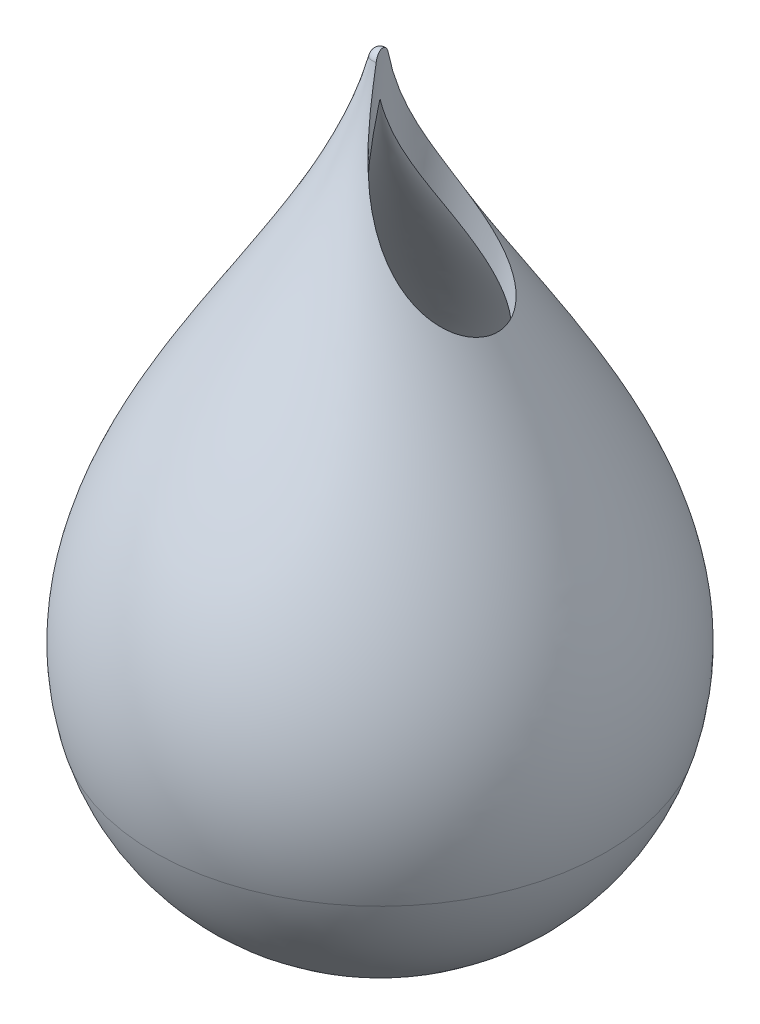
ISO-10303-21;
HEADER;
FILE_DESCRIPTION(('STEP AP214'),'2;1');
FILE_NAME('part.step','',(''),(''),'','','');
FILE_SCHEMA(('AUTOMOTIVE_DESIGN { 1 0 10303 214 1 1 1 1 }'));
ENDSEC;
DATA;
#1=APPLICATION_CONTEXT('core data for automotive mechanical design processes');
#2=APPLICATION_PROTOCOL_DEFINITION('international standard','automotive_design',2000,#1);
#3=PRODUCT_CONTEXT('',#1,'mechanical');
#4=PRODUCT('Part','Part','',(#3));
#5=PRODUCT_RELATED_PRODUCT_CATEGORY('part','',(#4));
#6=PRODUCT_DEFINITION_FORMATION('','',#4);
#7=PRODUCT_DEFINITION_CONTEXT('part definition',#1,'design');
#8=PRODUCT_DEFINITION('design','',#6,#7);
#9=PRODUCT_DEFINITION_SHAPE('','',#8);
#10=(LENGTH_UNIT() NAMED_UNIT(*) SI_UNIT(.MILLI.,.METRE.));
#11=(NAMED_UNIT(*) PLANE_ANGLE_UNIT() SI_UNIT($,.RADIAN.));
#12=(NAMED_UNIT(*) SI_UNIT($,.STERADIAN.) SOLID_ANGLE_UNIT());
#13=UNCERTAINTY_MEASURE_WITH_UNIT(LENGTH_MEASURE(1.E-05),#10,'distance_accuracy_value','');
#14=(GEOMETRIC_REPRESENTATION_CONTEXT(3) GLOBAL_UNCERTAINTY_ASSIGNED_CONTEXT((#13)) GLOBAL_UNIT_ASSIGNED_CONTEXT((#10,
#11,#12)) REPRESENTATION_CONTEXT('',''));
#15=CARTESIAN_POINT('',(0.,0.,0.));
#16=DIRECTION('',(0.,0.,1.));
#17=DIRECTION('',(1.,0.,0.));
#18=AXIS2_PLACEMENT_3D('',#15,#16,#17);
#19=CARTESIAN_POINT('',(39.065809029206,-17.924125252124,-0.0433741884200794));
#20=CARTESIAN_POINT('',(50.2641897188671,21.3896681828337,-0.0433741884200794));
#21=CARTESIAN_POINT('',(1.17037827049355,54.4718172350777,-0.0433741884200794));
#22=CARTESIAN_POINT('',(0.167136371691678,91.2274225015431,-0.0433741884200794));
#23=B_SPLINE_CURVE_WITH_KNOTS('',3,(#19,#20,#21,#22),.UNSPECIFIED.,.F.,.F.,(4,4),(0.,1.),.UNSPECIFIED.);
#24=CARTESIAN_POINT('',(0.167136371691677,102.320989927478,-0.0433741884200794));
#25=DIRECTION('',(0.,1.,0.));
#26=AXIS1_PLACEMENT('',#24,#25);
#27=SURFACE_OF_REVOLUTION('',#23,#26);
#28=CARTESIAN_POINT('',(0.167136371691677,-17.9241252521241,-0.0433741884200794));
#29=DIRECTION('',(0.,1.,0.));
#30=DIRECTION('',(0.,0.,1.));
#31=AXIS2_PLACEMENT_3D('',#28,#29,#30);
#32=CIRCLE('',#31,38.8986726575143);
#33=CARTESIAN_POINT('',(39.065809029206,-17.9241252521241,-0.0433741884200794));
#34=VERTEX_POINT('',#33);
#35=EDGE_CURVE('E109',#34,#34,#32,.T.);
#36=ORIENTED_EDGE('',*,*,#35,.T.);
#37=EDGE_LOOP('',(#36));
#38=FACE_BOUND('',#37,.T.);
#39=CARTESIAN_POINT('',(0.167136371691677,81.3332826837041,-0.0433741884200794));
#40=DIRECTION('',(0.,1.,0.));
#41=DIRECTION('',(0.,0.,1.));
#42=AXIS2_PLACEMENT_3D('',#39,#40,#41);
#43=CIRCLE('',#42,1.37315692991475);
#44=CARTESIAN_POINT('',(0.155733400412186,81.3332826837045,-1.41648377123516));
#45=VERTEX_POINT('',#44);
#46=CARTESIAN_POINT('',(0.754571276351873,81.3332826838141,1.19778663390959));
#47=VERTEX_POINT('',#46);
#48=EDGE_CURVE('E66',#45,#47,#43,.T.);
#49=ORIENTED_EDGE('',*,*,#48,.F.);
#50=CARTESIAN_POINT('',(17.5928872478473,48.1302874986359,-0.0433741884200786));
#51=CARTESIAN_POINT('',(17.5458518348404,48.2054790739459,0.204368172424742));
#52=CARTESIAN_POINT('',(17.4893487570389,48.2873817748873,0.448332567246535));
#53=CARTESIAN_POINT('',(17.3587502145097,48.4637703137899,0.926946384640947));
#54=CARTESIAN_POINT('',(17.2846429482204,48.5582645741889,1.16158943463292));
#55=CARTESIAN_POINT('',(17.1202034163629,48.759084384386,1.62059225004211));
#56=CARTESIAN_POINT('',(17.0298329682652,48.8654375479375,1.84492622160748));
#57=CARTESIAN_POINT('',(16.8344182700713,49.0892310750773,2.2812513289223));
#58=CARTESIAN_POINT('',(16.7293769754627,49.2066692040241,2.49324493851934));
#59=CARTESIAN_POINT('',(16.5068700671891,49.451223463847,2.90257402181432));
#60=CARTESIAN_POINT('',(16.3894851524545,49.578275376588,3.09999190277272));
#61=CARTESIAN_POINT('',(16.1433792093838,49.8419493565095,3.48085495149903));
#62=CARTESIAN_POINT('',(16.01465789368,49.9785716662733,3.66429976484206));
#63=CARTESIAN_POINT('',(15.7475783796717,50.2605362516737,4.01665038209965));
#64=CARTESIAN_POINT('',(15.6092258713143,50.4058733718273,4.18556464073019));
#65=CARTESIAN_POINT('',(15.3243684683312,50.7045979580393,4.50879396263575));
#66=CARTESIAN_POINT('',(15.1778619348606,50.8579870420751,4.66310607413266));
#67=CARTESIAN_POINT('',(14.8170903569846,51.2361242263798,5.01705118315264));
#68=CARTESIAN_POINT('',(14.5995450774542,51.4644767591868,5.20952322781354));
#69=CARTESIAN_POINT('',(14.1550293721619,51.9338389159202,5.56606348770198));
#70=CARTESIAN_POINT('',(13.9280559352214,52.1748525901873,5.73012254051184));
#71=CARTESIAN_POINT('',(13.4676287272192,52.6683046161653,6.03110378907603));
#72=CARTESIAN_POINT('',(13.2341641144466,52.9207625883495,6.16797703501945));
#73=CARTESIAN_POINT('',(12.7640414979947,53.4352607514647,6.41555175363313));
#74=CARTESIAN_POINT('',(12.5273833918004,53.6973012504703,6.52625238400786));
#75=CARTESIAN_POINT('',(11.963711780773,54.3304335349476,6.76019255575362));
#76=CARTESIAN_POINT('',(11.6363439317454,54.7053200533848,6.87236623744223));
#77=CARTESIAN_POINT('',(10.9854406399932,55.4684942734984,7.05414219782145));
#78=CARTESIAN_POINT('',(10.6619066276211,55.8567867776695,7.12372904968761));
#79=CARTESIAN_POINT('',(10.022607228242,56.6449946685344,7.22463558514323));
#80=CARTESIAN_POINT('',(9.70684819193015,57.0449190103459,7.255924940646));
#81=CARTESIAN_POINT('',(9.08660377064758,57.85446388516,7.2843472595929));
#82=CARTESIAN_POINT('',(8.78211847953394,58.2640844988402,7.2814799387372));
#83=CARTESIAN_POINT('',(8.04386027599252,59.2907266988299,7.23702610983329));
#84=CARTESIAN_POINT('',(7.61823226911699,59.9128676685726,7.17750409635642));
#85=CARTESIAN_POINT('',(6.80269233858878,61.1729179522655,7.00477868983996));
#86=CARTESIAN_POINT('',(6.41279700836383,61.8108344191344,6.8915505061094));
#87=CARTESIAN_POINT('',(5.67156719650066,63.1014048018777,6.62247972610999));
#88=CARTESIAN_POINT('',(5.32030514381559,63.7540837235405,6.46655893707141));
#89=CARTESIAN_POINT('',(4.65891463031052,65.0715211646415,6.12266169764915));
#90=CARTESIAN_POINT('',(4.34878495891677,65.7362793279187,5.9346861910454));
#91=CARTESIAN_POINT('',(3.75700096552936,67.1069701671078,5.52733253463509));
#92=CARTESIAN_POINT('',(3.47724296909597,67.8134138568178,5.30692529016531));
#93=CARTESIAN_POINT('',(3.09079325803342,68.8816243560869,4.96541240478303));
#94=CARTESIAN_POINT('',(2.96747645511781,69.2392253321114,4.84972206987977));
#95=CARTESIAN_POINT('',(2.73171266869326,69.9571863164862,4.61584753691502));
#96=CARTESIAN_POINT('',(2.61926564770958,70.3175463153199,4.49766334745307));
#97=CARTESIAN_POINT('',(2.29797581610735,71.4027984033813,4.14093066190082));
#98=CARTESIAN_POINT('',(2.10520873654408,72.1317946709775,3.90022416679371));
#99=CARTESIAN_POINT('',(1.76059740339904,73.5990616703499,3.42158612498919));
#100=CARTESIAN_POINT('',(1.60869902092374,74.3373187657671,3.18365131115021));
#101=CARTESIAN_POINT('',(1.34228898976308,75.8234301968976,2.71768834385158));
#102=CARTESIAN_POINT('',(1.22776722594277,76.5712818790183,2.48965752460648));
#103=CARTESIAN_POINT('',(1.08096144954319,77.6996846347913,2.15986363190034));
#104=CARTESIAN_POINT('',(1.03619229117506,78.0768843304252,2.05198475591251));
#105=CARTESIAN_POINT('',(0.954378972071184,78.8334322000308,1.84094233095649));
#106=CARTESIAN_POINT('',(0.917334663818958,79.2127803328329,1.73777869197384));
#107=CARTESIAN_POINT('',(0.842498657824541,80.0626655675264,1.5131502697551));
#108=CARTESIAN_POINT('',(0.806567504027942,80.5337326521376,1.39306456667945));
#109=CARTESIAN_POINT('',(0.759808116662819,81.2423370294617,1.21934904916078));
#110=CARTESIAN_POINT('',(0.745411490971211,81.4788663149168,1.1625141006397));
#111=CARTESIAN_POINT('',(0.718809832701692,81.9525451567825,1.05094604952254));
#112=CARTESIAN_POINT('',(0.706604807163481,82.1896947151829,0.996212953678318));
#113=CARTESIAN_POINT('',(0.684147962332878,82.6652518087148,0.888570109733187));
#114=CARTESIAN_POINT('',(0.673902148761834,82.9036609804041,0.835666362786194));
#115=CARTESIAN_POINT('',(0.655162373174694,83.3809172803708,0.731554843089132));
#116=CARTESIAN_POINT('',(0.646668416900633,83.6197644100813,0.680347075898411));
#117=CARTESIAN_POINT('',(0.631122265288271,84.0976325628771,0.579050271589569));
#118=CARTESIAN_POINT('',(0.624069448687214,84.3366534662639,0.528960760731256));
#119=CARTESIAN_POINT('',(0.614191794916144,84.6951502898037,0.453581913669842));
#120=CARTESIAN_POINT('',(0.611016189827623,84.8146427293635,0.428415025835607));
#121=CARTESIAN_POINT('',(0.604795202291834,85.0535382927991,0.377645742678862));
#122=CARTESIAN_POINT('',(0.601749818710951,85.1729414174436,0.352043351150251));
#123=CARTESIAN_POINT('',(0.597101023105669,85.3540678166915,0.312378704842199));
#124=CARTESIAN_POINT('',(0.59550952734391,85.4158744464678,0.298697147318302));
#125=CARTESIAN_POINT('',(0.592280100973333,85.539420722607,0.270902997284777));
#126=CARTESIAN_POINT('',(0.59064214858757,85.6011603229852,0.256790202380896));
#127=CARTESIAN_POINT('',(0.587267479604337,85.7245663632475,0.227918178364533));
#128=CARTESIAN_POINT('',(0.585530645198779,85.7862326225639,0.213158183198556));
#129=CARTESIAN_POINT('',(0.581884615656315,85.9090406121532,0.182735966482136));
#130=CARTESIAN_POINT('',(0.579976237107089,85.970183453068,0.16707813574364));
#131=CARTESIAN_POINT('',(0.575845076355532,86.0920056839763,0.134248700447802));
#132=CARTESIAN_POINT('',(0.573622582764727,86.1526854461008,0.117078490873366));
#133=CARTESIAN_POINT('',(0.569818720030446,86.2429871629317,0.089222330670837));
#134=CARTESIAN_POINT('',(0.568473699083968,86.2729439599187,0.0795955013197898));
#135=CARTESIAN_POINT('',(0.565546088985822,86.3324909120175,0.05930690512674));
#136=CARTESIAN_POINT('',(0.563963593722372,86.3620812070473,0.0486455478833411));
#137=CARTESIAN_POINT('',(0.561504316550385,86.4025432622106,0.0327489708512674));
#138=CARTESIAN_POINT('',(0.560794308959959,86.4137030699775,0.0282230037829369));
#139=CARTESIAN_POINT('',(0.55930048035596,86.4358913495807,0.0188596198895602));
#140=CARTESIAN_POINT('',(0.558516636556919,86.4469197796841,0.0140221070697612));
#141=CARTESIAN_POINT('',(0.556853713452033,86.4688004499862,0.0039480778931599));
#142=CARTESIAN_POINT('',(0.555974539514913,86.4796525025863,-0.00128883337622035));
#143=CARTESIAN_POINT('',(0.554089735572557,86.5010757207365,-0.0122842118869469));
#144=CARTESIAN_POINT('',(0.553084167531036,86.511647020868,-0.0180424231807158));
#145=CARTESIAN_POINT('',(0.550889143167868,86.5324105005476,-0.0303180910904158));
#146=CARTESIAN_POINT('',(0.549698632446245,86.542600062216,-0.036839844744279));
#147=CARTESIAN_POINT('',(0.547050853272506,86.5621546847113,-0.0509461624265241));
#148=CARTESIAN_POINT('',(0.545594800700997,86.5715232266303,-0.0585258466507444));
#149=CARTESIAN_POINT('',(0.542584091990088,86.5869329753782,-0.0736861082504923));
#150=CARTESIAN_POINT('',(0.541105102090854,86.5932662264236,-0.0809735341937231));
#151=CARTESIAN_POINT('',(0.537693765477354,86.6037338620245,-0.0972434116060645));
#152=CARTESIAN_POINT('',(0.535756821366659,86.6078444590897,-0.106242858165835));
#153=CARTESIAN_POINT('',(0.532151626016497,86.6109045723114,-0.122393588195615));
#154=CARTESIAN_POINT('',(0.530569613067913,86.6110091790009,-0.129319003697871));
#155=CARTESIAN_POINT('',(0.527435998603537,86.6088472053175,-0.142727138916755));
#156=CARTESIAN_POINT('',(0.525884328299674,86.6065868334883,-0.14921097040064));
#157=CARTESIAN_POINT('',(0.521913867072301,86.5985080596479,-0.165502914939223));
#158=CARTESIAN_POINT('',(0.519616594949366,86.5913179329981,-0.174601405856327));
#159=CARTESIAN_POINT('',(0.516086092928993,86.5779833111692,-0.188288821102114));
#160=CARTESIAN_POINT('',(0.514753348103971,86.5722884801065,-0.193370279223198));
#161=CARTESIAN_POINT('',(0.512199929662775,86.5604220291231,-0.202983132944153));
#162=CARTESIAN_POINT('',(0.510979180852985,86.5542507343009,-0.207514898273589));
#163=CARTESIAN_POINT('',(0.508618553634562,86.541570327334,-0.216183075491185));
#164=CARTESIAN_POINT('',(0.507479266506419,86.5350592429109,-0.220316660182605));
#165=CARTESIAN_POINT('',(0.505271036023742,86.5218286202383,-0.228251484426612));
#166=CARTESIAN_POINT('',(0.504202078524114,86.5151091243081,-0.232052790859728));
#167=CARTESIAN_POINT('',(0.500962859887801,86.4939716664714,-0.243474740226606));
#168=CARTESIAN_POINT('',(0.498888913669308,86.4792971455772,-0.250645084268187));
#169=CARTESIAN_POINT('',(0.494907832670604,86.4495725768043,-0.264218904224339));
#170=CARTESIAN_POINT('',(0.493000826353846,86.4345222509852,-0.270621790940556));
#171=CARTESIAN_POINT('',(0.487452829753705,86.3889625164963,-0.289038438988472));
#172=CARTESIAN_POINT('',(0.483993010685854,86.3581017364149,-0.300232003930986));
#173=CARTESIAN_POINT('',(0.477358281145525,86.2959062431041,-0.321361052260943));
#174=CARTESIAN_POINT('',(0.474183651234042,86.264571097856,-0.331295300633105));
#175=CARTESIAN_POINT('',(0.46803748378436,86.2016705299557,-0.350296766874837));
#176=CARTESIAN_POINT('',(0.465065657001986,86.1701055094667,-0.359365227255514));
#177=CARTESIAN_POINT('',(0.456427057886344,86.0758547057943,-0.38549229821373));
#178=CARTESIAN_POINT('',(0.450966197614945,86.0129150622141,-0.401694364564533));
#179=CARTESIAN_POINT('',(0.44037896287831,85.886686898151,-0.43281005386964));
#180=CARTESIAN_POINT('',(0.435252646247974,85.8233983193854,-0.44772345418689));
#181=CARTESIAN_POINT('',(0.425228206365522,85.6965597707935,-0.476751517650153));
#182=CARTESIAN_POINT('',(0.42033029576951,85.6330096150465,-0.490865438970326));
#183=CARTESIAN_POINT('',(0.410706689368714,85.5057818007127,-0.518569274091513));
#184=CARTESIAN_POINT('',(0.405980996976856,85.4421041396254,-0.532159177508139));
#185=CARTESIAN_POINT('',(0.392026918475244,85.2512788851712,-0.572361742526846));
#186=CARTESIAN_POINT('',(0.382996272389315,85.1240130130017,-0.598479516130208));
#187=CARTESIAN_POINT('',(0.365300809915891,84.8694170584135,-0.650238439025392));
#188=CARTESIAN_POINT('',(0.356635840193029,84.7420870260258,-0.67587978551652));
#189=CARTESIAN_POINT('',(0.336749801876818,84.4449474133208,-0.735696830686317));
#190=CARTESIAN_POINT('',(0.325639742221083,84.2751292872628,-0.769867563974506));
#191=CARTESIAN_POINT('',(0.303847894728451,83.9355866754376,-0.83880608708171));
#192=CARTESIAN_POINT('',(0.293166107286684,83.7658621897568,-0.873573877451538));
#193=CARTESIAN_POINT('',(0.26172724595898,83.2569024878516,-0.97933391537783));
#194=CARTESIAN_POINT('',(0.241579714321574,82.9179268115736,-1.05177385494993));
#195=CARTESIAN_POINT('',(0.203081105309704,82.2410469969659,-1.20195577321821));
#196=CARTESIAN_POINT('',(0.184730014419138,81.9031428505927,-1.27969771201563));
#197=CARTESIAN_POINT('',(0.150182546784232,81.2281659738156,-1.4411368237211));
#198=CARTESIAN_POINT('',(0.133989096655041,80.891094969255,-1.52484185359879));
#199=CARTESIAN_POINT('',(0.104248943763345,80.2183771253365,-1.698323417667));
#200=CARTESIAN_POINT('',(0.0907023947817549,79.882730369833,-1.78810030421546));
#201=CARTESIAN_POINT('',(0.0667673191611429,79.2129716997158,-1.9737131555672));
#202=CARTESIAN_POINT('',(0.0563791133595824,78.8788599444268,-2.06954973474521));
#203=CARTESIAN_POINT('',(0.0305685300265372,77.8717794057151,-2.36810256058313));
#204=CARTESIAN_POINT('',(0.0208453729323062,77.2013420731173,-2.57998395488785));
#205=CARTESIAN_POINT('',(0.0210276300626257,75.8677302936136,-3.02590047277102));
#206=CARTESIAN_POINT('',(0.0309371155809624,75.2045573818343,-3.25994018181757));
#207=CARTESIAN_POINT('',(0.0749358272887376,73.8858458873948,-3.74710471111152));
#208=CARTESIAN_POINT('',(0.109031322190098,73.2303093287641,-4.00023446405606));
#209=CARTESIAN_POINT('',(0.205752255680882,71.9286372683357,-4.52121757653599));
#210=CARTESIAN_POINT('',(0.268324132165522,71.2824864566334,-4.78904246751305));
#211=CARTESIAN_POINT('',(0.426181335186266,69.9988589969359,-5.33528467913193));
#212=CARTESIAN_POINT('',(0.521459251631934,69.361380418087,-5.61369958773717));
#213=CARTESIAN_POINT('',(0.748601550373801,68.0957022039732,-6.1758376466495));
#214=CARTESIAN_POINT('',(0.880443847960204,67.4674972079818,-6.45955749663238));
#215=CARTESIAN_POINT('',(1.10670283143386,66.538281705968,-6.88205016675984));
#216=CARTESIAN_POINT('',(1.18596914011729,66.2336213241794,-7.02103188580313));
#217=CARTESIAN_POINT('',(1.35441436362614,65.6266783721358,-7.2981011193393));
#218=CARTESIAN_POINT('',(1.44359202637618,65.3243955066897,-7.43618874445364));
#219=CARTESIAN_POINT('',(1.63226610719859,64.7217893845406,-7.7109094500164));
#220=CARTESIAN_POINT('',(1.73177820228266,64.4214698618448,-7.84753996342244));
#221=CARTESIAN_POINT('',(1.94119593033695,63.8232806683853,-8.1183439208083));
#222=CARTESIAN_POINT('',(2.05110357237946,63.5254114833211,-8.25251688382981));
#223=CARTESIAN_POINT('',(2.32248451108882,62.8275095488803,-8.56424578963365));
#224=CARTESIAN_POINT('',(2.48845464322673,62.4285732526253,-8.74037634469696));
#225=CARTESIAN_POINT('',(2.84110206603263,61.6359298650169,-9.08378449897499));
#226=CARTESIAN_POINT('',(3.02778396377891,61.2422239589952,-9.2510601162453));
#227=CARTESIAN_POINT('',(3.42249274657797,60.4605541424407,-9.57391223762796));
#228=CARTESIAN_POINT('',(3.63052577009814,60.0725919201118,-9.72948535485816));
#229=CARTESIAN_POINT('',(4.06788636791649,59.3036765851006,-10.0255875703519));
#230=CARTESIAN_POINT('',(4.29718586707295,58.9227150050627,-10.1661359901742));
#231=CARTESIAN_POINT('',(4.77715747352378,58.1681325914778,-10.4290735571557));
#232=CARTESIAN_POINT('',(5.02782495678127,57.7945101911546,-10.5514666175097));
#233=CARTESIAN_POINT('',(5.54992443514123,57.0556588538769,-10.774507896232));
#234=CARTESIAN_POINT('',(5.82134333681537,56.6904248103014,-10.8751696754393));
#235=CARTESIAN_POINT('',(6.34950439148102,56.0136478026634,-11.0401879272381));
#236=CARTESIAN_POINT('',(6.60394398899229,55.7010275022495,-11.1074873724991));
#237=CARTESIAN_POINT('',(7.12724741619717,55.0839184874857,-11.2196813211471));
#238=CARTESIAN_POINT('',(7.39610994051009,54.7794290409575,-11.264577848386));
#239=CARTESIAN_POINT('',(7.94674885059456,54.180085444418,-11.3288871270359));
#240=CARTESIAN_POINT('',(8.22851156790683,53.8852216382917,-11.3483262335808));
#241=CARTESIAN_POINT('',(8.80352958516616,53.3063526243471,-11.3584886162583));
#242=CARTESIAN_POINT('',(9.09678305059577,53.0223456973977,-11.3492164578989));
#243=CARTESIAN_POINT('',(9.63862230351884,52.5173112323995,-11.3030445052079));
#244=CARTESIAN_POINT('',(9.88569853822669,52.2941804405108,-11.2714425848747));
#245=CARTESIAN_POINT('',(10.3843477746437,51.8577189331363,-11.1846997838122));
#246=CARTESIAN_POINT('',(10.6359202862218,51.6443871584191,-11.1295614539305));
#247=CARTESIAN_POINT('',(11.1413708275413,51.2289113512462,-10.9940106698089));
#248=CARTESIAN_POINT('',(11.395247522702,51.0267612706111,-10.9136120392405));
#249=CARTESIAN_POINT('',(11.7758212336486,50.7328727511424,-10.773124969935));
#250=CARTESIAN_POINT('',(11.9026506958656,50.6364574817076,-10.722975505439));
#251=CARTESIAN_POINT('',(12.1558897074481,50.4468515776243,-10.6159432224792));
#252=CARTESIAN_POINT('',(12.2822992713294,50.353660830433,-10.5590606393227));
#253=CARTESIAN_POINT('',(12.5111180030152,50.187469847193,-10.4496060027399));
#254=CARTESIAN_POINT('',(12.6136638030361,50.1139094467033,-10.3981664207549));
#255=CARTESIAN_POINT('',(12.8179918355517,49.9690680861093,-10.2907837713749));
#256=CARTESIAN_POINT('',(12.9197740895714,49.8977870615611,-10.2348408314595));
#257=CARTESIAN_POINT('',(13.2236437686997,49.6876071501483,-10.0601068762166));
#258=CARTESIAN_POINT('',(13.4243185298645,49.5523246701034,-9.93438013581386));
#259=CARTESIAN_POINT('',(13.8198018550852,49.2927232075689,-9.6640163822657));
#260=CARTESIAN_POINT('',(14.0146126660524,49.1683999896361,-9.51938672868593));
#261=CARTESIAN_POINT('',(14.396350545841,48.9317084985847,-9.21111947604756));
#262=CARTESIAN_POINT('',(14.583277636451,48.8193401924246,-9.04748192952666));
#263=CARTESIAN_POINT('',(14.9483222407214,48.6067204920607,-8.70040200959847));
#264=CARTESIAN_POINT('',(15.1263669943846,48.5065617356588,-8.51682606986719));
#265=CARTESIAN_POINT('',(15.4699404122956,48.320072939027,-8.13175833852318));
#266=CARTESIAN_POINT('',(15.6354684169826,48.2337436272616,-7.93026560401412));
#267=CARTESIAN_POINT('',(15.95180341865,48.0755606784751,-7.51075276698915));
#268=CARTESIAN_POINT('',(16.1026124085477,48.0037050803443,-7.29273490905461));
#269=CARTESIAN_POINT('',(16.3875091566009,47.8749837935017,-6.84186511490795));
#270=CARTESIAN_POINT('',(16.5215991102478,47.818116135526,-6.60901513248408));
#271=CARTESIAN_POINT('',(16.7564528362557,47.7256419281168,-6.1588703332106));
#272=CARTESIAN_POINT('',(16.8592828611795,47.6883143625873,-5.943002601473));
#273=CARTESIAN_POINT('',(17.0494716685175,47.6259171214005,-5.50284498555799));
#274=CARTESIAN_POINT('',(17.1368315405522,47.600846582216,-5.27855569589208));
#275=CARTESIAN_POINT('',(17.2951479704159,47.5631976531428,-4.82327322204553));
#276=CARTESIAN_POINT('',(17.366106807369,47.5506175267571,-4.59228097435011));
#277=CARTESIAN_POINT('',(17.4909067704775,47.5381211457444,-4.12538657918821));
#278=CARTESIAN_POINT('',(17.5447488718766,47.5382041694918,-3.88948471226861));
#279=CARTESIAN_POINT('',(17.632312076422,47.5507686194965,-3.42790996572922));
#280=CARTESIAN_POINT('',(17.6669860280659,47.562559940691,-3.20239825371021));
#281=CARTESIAN_POINT('',(17.7204181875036,47.5975138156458,-2.75037882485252));
#282=CARTESIAN_POINT('',(17.7391770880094,47.6206758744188,-2.52387115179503));
#283=CARTESIAN_POINT('',(17.7607764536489,47.6782138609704,-2.07191090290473));
#284=CARTESIAN_POINT('',(17.7636430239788,47.7125713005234,-1.84645720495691));
#285=CARTESIAN_POINT('',(17.753768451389,47.7922786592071,-1.39793445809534));
#286=CARTESIAN_POINT('',(17.7410338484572,47.8376239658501,-1.17486444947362));
#287=CARTESIAN_POINT('',(17.7066086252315,47.9235640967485,-0.799817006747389));
#288=CARTESIAN_POINT('',(17.6888153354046,47.9614154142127,-0.64683424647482));
#289=CARTESIAN_POINT('',(17.6461215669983,48.0421290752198,-0.343235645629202));
#290=CARTESIAN_POINT('',(17.6212223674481,48.084990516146,-0.192619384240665));
#291=CARTESIAN_POINT('',(17.5928872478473,48.1302874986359,-0.0433741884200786));
#292=B_SPLINE_CURVE_WITH_KNOTS('',3,(#50,#51,#52,#53,#54,#55,#56,#57,#58,#59,#60,#61,#62,#63,
#64,#65,#66,#67,#68,#69,#70,#71,#72,#73,#74,#75,#76,#77,#78,#79,#80,#81,#82,#83,#84,#85,#86,#87,
#88,#89,#90,#91,#92,#93,#94,#95,#96,#97,#98,#99,#100,#101,#102,#103,#104,#105,#106,#107,#108,
#109,#110,#111,#112,#113,#114,#115,#116,#117,#118,#119,#120,#121,#122,#123,#124,#125,#126,#127,
#128,#129,#130,#131,#132,#133,#134,#135,#136,#137,#138,#139,#140,#141,#142,#143,#144,#145,#146,
#147,#148,#149,#150,#151,#152,#153,#154,#155,#156,#157,#158,#159,#160,#161,#162,#163,#164,#165,
#166,#167,#168,#169,#170,#171,#172,#173,#174,#175,#176,#177,#178,#179,#180,#181,#182,#183,#184,
#185,#186,#187,#188,#189,#190,#191,#192,#193,#194,#195,#196,#197,#198,#199,#200,#201,#202,#203,
#204,#205,#206,#207,#208,#209,#210,#211,#212,#213,#214,#215,#216,#217,#218,#219,#220,#221,#222,
#223,#224,#225,#226,#227,#228,#229,#230,#231,#232,#233,#234,#235,#236,#237,#238,#239,#240,#241,
#242,#243,#244,#245,#246,#247,#248,#249,#250,#251,#252,#253,#254,#255,#256,#257,#258,#259,#260,
#261,#262,#263,#264,#265,#266,#267,#268,#269,#270,#271,#272,#273,#274,#275,#276,#277,#278,#279,
#280,#281,#282,#283,#284,#285,#286,#287,#288,#289,#290,#291),.UNSPECIFIED.,.T.,.F.,(4,2,2,2,2,2,
2,2,2,2,2,2,2,2,2,2,2,2,2,2,2,2,2,2,2,2,2,2,2,2,2,2,2,2,2,2,2,2,2,2,2,2,2,2,2,2,2,2,2,2,2,2,2,2,
2,2,2,2,2,2,2,2,2,2,2,2,2,2,2,2,2,2,2,2,2,2,2,2,2,2,2,2,2,2,2,2,2,2,2,2,2,2,2,2,2,2,2,2,2,2,2,2,
2,2,2,2,2,2,2,2,2,2,2,2,2,2,2,2,2,2,4),(0.,0.789249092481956,1.57902878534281,2.37068749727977,
3.16218695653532,3.94880043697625,4.73543386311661,5.52160644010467,6.3079376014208,
7.41474487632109,8.52190840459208,9.63104773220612,10.7402227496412,12.2684822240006,
13.7972949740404,15.3273176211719,16.8573530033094,19.1222701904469,21.3882338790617,
23.6583758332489,25.9284509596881,28.300152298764,29.4867025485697,30.6732487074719,
33.0465672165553,35.4167267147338,37.7862442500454,38.9707617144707,40.1552565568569,
41.6174250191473,42.3484715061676,43.0795203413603,43.8127754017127,44.5460328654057,
45.2789735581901,45.6454393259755,46.011901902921,46.2018692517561,46.3919271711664,
46.5822164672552,46.771643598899,46.9608978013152,47.0553710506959,47.1498070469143,
47.1859941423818,47.2221924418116,47.2584270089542,47.2946438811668,47.3310753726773,
47.367344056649,47.3964822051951,47.4259263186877,47.4467883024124,47.4675956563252,
47.502445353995,47.5256849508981,47.5489088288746,47.5722870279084,47.5956605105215,
47.6450097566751,47.6943966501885,47.7933632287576,47.8924261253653,47.9913446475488,
48.1869757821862,48.382640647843,48.578484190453,48.7743316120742,49.1650219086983,
49.5555467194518,50.0762788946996,50.5970115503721,51.6386171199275,52.6802148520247,
53.7232113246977,54.7662683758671,55.8094313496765,57.9183094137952,60.0276248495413,
62.137487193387,64.243397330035,66.3488306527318,68.4529950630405,69.4852233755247,
70.5173214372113,71.5510086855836,72.5848961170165,73.9841565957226,75.3837289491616,
76.7837048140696,78.1818581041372,79.5797095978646,80.9766862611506,82.2017946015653,
83.4267922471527,84.6505206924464,85.874054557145,86.8763852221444,87.8786072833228,
88.8802818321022,89.3812122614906,89.8821251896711,90.2908764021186,90.6996160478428,
91.5168401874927,92.3337470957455,93.1506517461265,93.9734125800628,94.796216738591,
95.618909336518,96.441493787,97.1665888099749,97.8916327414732,98.6165758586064,
99.3414776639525,100.026045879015,100.710584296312,101.393997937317,102.077125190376,
102.552670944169,103.028131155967),.UNSPECIFIED.);
#293=EDGE_CURVE('E105',#45,#47,#292,.T.);
#294=ORIENTED_EDGE('',*,*,#293,.T.);
#295=EDGE_LOOP('',(#49,#294));
#296=FACE_BOUND('',#295,.T.);
#297=ADVANCED_FACE('F47',(#38,#296),#27,.T.);
#298=CARTESIAN_POINT('',(-10.260757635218,15.4288895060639,24.0125867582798));
#299=CARTESIAN_POINT('',(-6.7195908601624,23.0422655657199,13.8033076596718));
#300=CARTESIAN_POINT('',(1.82068491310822,41.4035389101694,-10.8185371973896));
#301=CARTESIAN_POINT('',(2.2914518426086,72.3273970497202,-8.40484421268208));
#302=CARTESIAN_POINT('',(2.56701849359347,90.4288895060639,-6.99197246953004));
#303=CARTESIAN_POINT('',(-9.59691533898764,15.4288895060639,24.3003523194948));
#304=CARTESIAN_POINT('',(-6.31767755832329,23.0422655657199,14.0794240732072));
#305=CARTESIAN_POINT('',(1.59090081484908,41.4035389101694,-10.5705151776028));
#306=CARTESIAN_POINT('',(2.11669723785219,72.3273970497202,-8.2201350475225));
#307=CARTESIAN_POINT('',(2.42447578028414,90.4288895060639,-6.84432391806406));
#308=CARTESIAN_POINT('',(-8.25835648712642,15.4288895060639,24.8165742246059));
#309=CARTESIAN_POINT('',(-5.49899487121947,23.0422655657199,14.5938321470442));
#310=CARTESIAN_POINT('',(1.15579171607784,41.4035389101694,-10.0604815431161));
#311=CARTESIAN_POINT('',(1.78547167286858,72.3273970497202,-7.84000373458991));
#312=CARTESIAN_POINT('',(2.15405915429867,90.4288895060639,-6.54023182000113));
#313=CARTESIAN_POINT('',(-6.22679885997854,15.4288895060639,25.4164980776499));
#314=CARTESIAN_POINT('',(-4.23274636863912,23.0422655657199,15.2531469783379));
#315=CARTESIAN_POINT('',(0.576334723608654,41.4035389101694,-9.25793275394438));
#316=CARTESIAN_POINT('',(1.34339112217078,72.3273970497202,-7.24103103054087));
#317=CARTESIAN_POINT('',(1.79239284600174,90.4288895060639,-6.06042377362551));
#318=CARTESIAN_POINT('',(-4.18042531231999,15.4288895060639,25.8455315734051));
#319=CARTESIAN_POINT('',(-2.9346171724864,23.0422655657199,15.8013415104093));
#320=CARTESIAN_POINT('',(0.0699137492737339,41.4035389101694,-8.4223560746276));
#321=CARTESIAN_POINT('',(0.955975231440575,72.3273970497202,-6.61664580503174));
#322=CARTESIAN_POINT('',(1.47463739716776,90.4288895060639,-5.55966091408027));
#323=CARTESIAN_POINT('',(8.13329092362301,15.4288895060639,27.4155022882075));
#324=CARTESIAN_POINT('',(5.00737949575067,23.0422655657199,18.4308487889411));
#325=CARTESIAN_POINT('',(-2.53141981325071,41.4035389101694,-3.2375513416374));
#326=CARTESIAN_POINT('',(-1.04109097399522,72.3273970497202,-2.73803860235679));
#327=CARTESIAN_POINT('',(-0.168716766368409,90.4288895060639,-2.44564539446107));
#328=CARTESIAN_POINT('',(19.618848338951,15.4288895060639,21.0059965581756));
#329=CARTESIAN_POINT('',(13.4326235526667,23.0422655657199,15.6753603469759));
#330=CARTESIAN_POINT('',(-1.48677138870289,41.4035389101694,2.81939896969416));
#331=CARTESIAN_POINT('',(-0.303166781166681,72.3273970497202,1.82513733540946));
#332=CARTESIAN_POINT('',(0.389664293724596,90.4288895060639,1.24313946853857));
#333=CARTESIAN_POINT('',(29.9784085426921,15.4288895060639,-2.89232610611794));
#334=CARTESIAN_POINT('',(23.3728144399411,23.0422655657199,1.20648148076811));
#335=CARTESIAN_POINT('',(7.44202132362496,41.4035389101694,11.0916265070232));
#336=CARTESIAN_POINT('',(6.34636316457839,72.3273970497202,8.11630310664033));
#337=CARTESIAN_POINT('',(5.70501214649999,90.4288895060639,6.37467714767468));
#338=CARTESIAN_POINT('',(23.8718763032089,15.4288895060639,-18.3440239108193));
#339=CARTESIAN_POINT('',(21.3301920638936,23.0422655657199,-9.80300124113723));
#340=CARTESIAN_POINT('',(15.2003807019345,41.4035389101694,10.795488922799));
#341=CARTESIAN_POINT('',(12.1831429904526,72.3273970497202,7.95466629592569));
#342=CARTESIAN_POINT('',(10.4169822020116,90.4288895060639,6.29177128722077));
#343=CARTESIAN_POINT('',(-2.68181554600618,15.4288895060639,-29.8546463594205));
#344=CARTESIAN_POINT('',(5.25365999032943,23.0422655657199,-20.8476577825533));
#345=CARTESIAN_POINT('',(24.3917446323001,41.4035389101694,0.874608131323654));
#346=CARTESIAN_POINT('',(19.1733271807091,72.3273970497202,0.566299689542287));
#347=CARTESIAN_POINT('',(16.118690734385,90.4288895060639,0.385829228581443));
#348=CARTESIAN_POINT('',(-18.1335133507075,15.4288895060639,-23.7481141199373));
#349=CARTESIAN_POINT('',(-5.7558227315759,23.0422655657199,-18.8050354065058));
#350=CARTESIAN_POINT('',(24.0956070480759,41.4035389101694,-6.8837512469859));
#351=CARTESIAN_POINT('',(19.0116903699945,72.3273970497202,-5.2704801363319));
#352=CARTESIAN_POINT('',(16.0357848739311,90.4288895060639,-4.32614082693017));
#353=CARTESIAN_POINT('',(-28.4930735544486,15.4288895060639,0.150208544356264));
#354=CARTESIAN_POINT('',(-15.6960136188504,23.0422655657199,-4.33615654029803));
#355=CARTESIAN_POINT('',(15.1668143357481,41.4035389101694,-15.1559787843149));
#356=CARTESIAN_POINT('',(12.3621604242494,72.3273970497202,-11.5616459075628));
#357=CARTESIAN_POINT('',(10.7204370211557,90.4288895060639,-9.45767850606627));
#358=CARTESIAN_POINT('',(-25.3190345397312,15.4288895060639,12.9144268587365));
#359=CARTESIAN_POINT('',(-15.2458262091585,23.0422655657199,4.51679693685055));
#360=CARTESIAN_POINT('',(9.04785509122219,41.4035389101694,-15.7358711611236));
#361=CARTESIAN_POINT('',(7.76513898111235,72.3273970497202,-12.0458985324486));
#362=CARTESIAN_POINT('',(7.0142923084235,90.4288895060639,-9.88594774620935));
#363=CARTESIAN_POINT('',(-15.7551933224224,15.4288895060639,20.8280452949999));
#364=CARTESIAN_POINT('',(-9.94238581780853,23.0422655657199,10.9869700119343));
#365=CARTESIAN_POINT('',(4.07643404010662,41.4035389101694,-12.7468731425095));
#366=CARTESIAN_POINT('',(4.00300013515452,72.3273970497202,-9.83723862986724));
#367=CARTESIAN_POINT('',(3.96001509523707,90.4288895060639,-8.13406411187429));
#368=CARTESIAN_POINT('',(-14.0431091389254,15.4288895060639,22.0282461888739));
#369=CARTESIAN_POINT('',(-8.96501349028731,23.0422655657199,12.0020562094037));
#370=CARTESIAN_POINT('',(3.28189268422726,41.4035389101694,-12.1782303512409));
#371=CARTESIAN_POINT('',(3.40101267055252,72.3273970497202,-9.41586103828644));
#372=CARTESIAN_POINT('',(3.47074037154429,90.4288895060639,-7.7988892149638));
#373=CARTESIAN_POINT('',(-12.2164329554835,15.4288895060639,23.1008081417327));
#374=CARTESIAN_POINT('',(-7.89535254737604,23.0422655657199,12.9475226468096));
#375=CARTESIAN_POINT('',(2.52585059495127,41.4035389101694,-11.5392817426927));
#376=CARTESIAN_POINT('',(2.82742409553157,72.3273970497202,-8.94130897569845));
#377=CARTESIAN_POINT('',(3.00395221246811,90.4288895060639,-7.42056779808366));
#378=CARTESIAN_POINT('',(-10.9245999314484,15.4288895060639,23.7248211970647));
#379=CARTESIAN_POINT('',(-7.1215041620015,23.0422655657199,13.5271912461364));
#380=CARTESIAN_POINT('',(2.05046901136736,41.4035389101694,-11.0665592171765));
#381=CARTESIAN_POINT('',(2.46620644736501,72.3273970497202,-8.58955337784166));
#382=CARTESIAN_POINT('',(2.70956120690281,90.4288895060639,-7.13962102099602));
#383=CARTESIAN_POINT('',(-10.260757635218,15.4288895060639,24.0125867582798));
#384=CARTESIAN_POINT('',(-6.7195908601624,23.0422655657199,13.8033076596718));
#385=CARTESIAN_POINT('',(1.82068491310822,41.4035389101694,-10.8185371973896));
#386=CARTESIAN_POINT('',(2.2914518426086,72.3273970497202,-8.40484421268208));
#387=CARTESIAN_POINT('',(2.56701849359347,90.4288895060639,-6.99197246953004));
#388=B_SPLINE_SURFACE_WITH_KNOTS('',3,3,((#298,#299,#300,#301,#302),(#303,#304,#305,#306,#307),
(#308,#309,#310,#311,#312),(#313,#314,#315,#316,#317),(#318,#319,#320,#321,#322),(#323,#324,
#325,#326,#327),(#328,#329,#330,#331,#332),(#333,#334,#335,#336,#337),(#338,#339,#340,#341,
#342),(#343,#344,#345,#346,#347),(#348,#349,#350,#351,#352),(#353,#354,#355,#356,#357),(#358,
#359,#360,#361,#362),(#363,#364,#365,#366,#367),(#368,#369,#370,#371,#372),(#373,#374,#375,#376,
#377),(#378,#379,#380,#381,#382),(#383,#384,#385,#386,#387)),.UNSPECIFIED.,.T.,.F.,.F.,(4,1,1,1,
1,2,2,2,1,1,1,1,4),(4,1,4),(0.,0.0125,0.0249999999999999,0.0375000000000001,0.05,0.25,0.5,0.75,
0.95,0.9625,0.975,0.9875,1.),(0.,0.414643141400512,1.),.UNSPECIFIED.);
#389=CARTESIAN_POINT('',(16.9840247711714,43.2255416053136,-0.0433741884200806));
#390=CARTESIAN_POINT('',(16.8096763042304,43.5014255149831,0.918717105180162));
#391=CARTESIAN_POINT('',(16.487230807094,43.8788144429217,1.83117736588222));
#392=CARTESIAN_POINT('',(15.634559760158,44.7922912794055,3.43890029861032));
#393=CARTESIAN_POINT('',(15.1051171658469,45.3277793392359,4.13496387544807));
#394=CARTESIAN_POINT('',(13.7174841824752,46.7350488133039,5.5169876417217));
#395=CARTESIAN_POINT('',(12.8106133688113,47.6574964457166,6.10014469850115));
#396=CARTESIAN_POINT('',(10.6681493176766,49.9623651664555,7.01675847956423));
#397=CARTESIAN_POINT('',(9.42651872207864,51.394019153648,7.19591145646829));
#398=CARTESIAN_POINT('',(6.62962815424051,55.0277305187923,7.07182773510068));
#399=CARTESIAN_POINT('',(5.17895819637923,57.29020516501,6.51984873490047));
#400=CARTESIAN_POINT('',(2.24669558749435,63.1543922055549,4.62023761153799));
#401=CARTESIAN_POINT('',(1.13726552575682,66.8434824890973,3.00872932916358));
#402=CARTESIAN_POINT('',(0.476754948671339,71.3405680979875,1.26383427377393));
#403=CARTESIAN_POINT('',(0.39177893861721,72.055782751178,0.992696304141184));
#404=CARTESIAN_POINT('',(0.288636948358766,73.1360634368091,0.595857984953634));
#405=CARTESIAN_POINT('',(0.258290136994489,73.4977995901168,0.465085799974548));
#406=CARTESIAN_POINT('',(0.218668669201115,74.0420074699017,0.272108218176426));
#407=CARTESIAN_POINT('',(0.206442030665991,74.223728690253,0.208294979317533));
#408=CARTESIAN_POINT('',(0.189513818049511,74.4967264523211,0.113435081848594));
#409=CARTESIAN_POINT('',(0.184105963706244,74.587802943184,0.0819557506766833));
#410=CARTESIAN_POINT('',(0.176332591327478,74.724493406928,0.0349225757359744));
#411=CARTESIAN_POINT('',(0.173797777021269,74.7700712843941,0.0192752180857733));
#412=CARTESIAN_POINT('',(0.170082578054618,74.8384799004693,-0.00413635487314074));
#413=CARTESIAN_POINT('',(0.168858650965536,74.8612903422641,-0.0119305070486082));
#414=CARTESIAN_POINT('',(0.167019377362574,74.8954546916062,-0.0237091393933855));
#415=CARTESIAN_POINT('',(0.166405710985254,74.9068344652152,-0.0276499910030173));
#416=CARTESIAN_POINT('',(0.16547736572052,74.9239145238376,-0.0336162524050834));
#417=CARTESIAN_POINT('',(0.165166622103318,74.9296093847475,-0.0356140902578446));
#418=CARTESIAN_POINT('',(0.164686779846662,74.9368102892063,-0.0385239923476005));
#419=CARTESIAN_POINT('',(0.164573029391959,74.9384290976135,-0.0392041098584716));
#420=CARTESIAN_POINT('',(0.164361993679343,74.940789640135,-0.0403935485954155));
#421=CARTESIAN_POINT('',(0.164285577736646,74.9415601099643,-0.0408147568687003));
#422=CARTESIAN_POINT('',(0.164141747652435,74.9423692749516,-0.0415349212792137));
#423=CARTESIAN_POINT('',(0.164110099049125,74.9425252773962,-0.0416908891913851));
#424=CARTESIAN_POINT('',(0.164045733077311,74.9427513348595,-0.0419977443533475));
#425=CARTESIAN_POINT('',(0.164015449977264,74.9428331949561,-0.042139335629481));
#426=CARTESIAN_POINT('',(0.163956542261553,74.9429230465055,-0.0424068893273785));
#427=CARTESIAN_POINT('',(0.163929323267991,74.9429442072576,-0.042528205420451));
#428=CARTESIAN_POINT('',(0.163873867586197,74.9429407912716,-0.0427700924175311));
#429=CARTESIAN_POINT('',(0.163845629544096,74.9429161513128,-0.0428906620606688));
#430=CARTESIAN_POINT('',(0.16377992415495,74.9428154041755,-0.0431662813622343));
#431=CARTESIAN_POINT('',(0.16374357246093,74.9427220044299,-0.0433144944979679));
#432=CARTESIAN_POINT('',(0.163624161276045,74.942346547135,-0.0437935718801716));
#433=CARTESIAN_POINT('',(0.163553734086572,74.9419929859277,-0.0440611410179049));
#434=CARTESIAN_POINT('',(0.16319682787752,74.9400331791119,-0.0453981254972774));
#435=CARTESIAN_POINT('',(0.162985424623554,74.9382353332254,-0.0461180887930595));
#436=CARTESIAN_POINT('',(0.161958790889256,74.9292936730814,-0.049592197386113));
#437=CARTESIAN_POINT('',(0.161208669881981,74.9220794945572,-0.0520587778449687));
#438=CARTESIAN_POINT('',(0.157482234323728,74.8859875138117,-0.0643099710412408));
#439=CARTESIAN_POINT('',(0.154570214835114,74.8569683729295,-0.0738764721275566));
#440=CARTESIAN_POINT('',(0.14007694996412,74.7119489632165,-0.121850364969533));
#441=CARTESIAN_POINT('',(0.128695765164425,74.5961732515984,-0.16068333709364));
#442=CARTESIAN_POINT('',(0.0729945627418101,74.0176852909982,-0.356661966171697));
#443=CARTESIAN_POINT('',(0.0323037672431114,73.556292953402,-0.519200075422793));
#444=CARTESIAN_POINT('',(-0.148410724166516,71.2541472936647,-1.36179656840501));
#445=CARTESIAN_POINT('',(-0.219131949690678,69.4382435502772,-2.12814465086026));
#446=CARTESIAN_POINT('',(-0.115281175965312,65.8611406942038,-3.77541467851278));
#447=CARTESIAN_POINT('',(0.0594704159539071,64.0999825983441,-4.6564200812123));
#448=CARTESIAN_POINT('',(0.694931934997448,60.8457892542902,-6.31794496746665));
#449=CARTESIAN_POINT('',(1.12008833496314,59.3453632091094,-7.09825616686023));
#450=CARTESIAN_POINT('',(2.62337139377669,55.5165492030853,-9.00212853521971));
#451=CARTESIAN_POINT('',(3.93933629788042,53.225655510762,-10.0543198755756));
#452=CARTESIAN_POINT('',(6.60407504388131,49.900050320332,-10.9510305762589));
#453=CARTESIAN_POINT('',(7.68824615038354,48.7532200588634,-11.1221115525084));
#454=CARTESIAN_POINT('',(9.80295805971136,46.8357339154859,-10.9717042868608));
#455=CARTESIAN_POINT('',(10.8083133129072,46.0344933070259,-10.7329654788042));
#456=CARTESIAN_POINT('',(12.5991370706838,44.762593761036,-9.90710887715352));
#457=CARTESIAN_POINT('',(13.3916643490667,44.2584060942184,-9.39027299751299));
#458=CARTESIAN_POINT('',(14.8256943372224,43.4411754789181,-8.05959262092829));
#459=CARTESIAN_POINT('',(15.466603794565,43.1288759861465,-7.24461218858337));
#460=CARTESIAN_POINT('',(16.4193908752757,42.7510406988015,-5.49403895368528));
#461=CARTESIAN_POINT('',(16.7560524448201,42.6655018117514,-4.57636074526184));
#462=CARTESIAN_POINT('',(17.1236994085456,42.7008331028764,-2.74862395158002));
#463=CARTESIAN_POINT('',(17.1738854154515,42.8080844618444,-1.84227767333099));
#464=CARTESIAN_POINT('',(17.079333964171,43.0614921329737,-0.65567700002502));
#465=CARTESIAN_POINT('',(17.0390569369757,43.1384603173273,-0.347053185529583));
#466=CARTESIAN_POINT('',(16.9840247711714,43.2255416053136,-0.0433741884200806));
#467=B_SPLINE_CURVE_WITH_KNOTS('',3,(#389,#390,#391,#392,#393,#394,#395,#396,#397,#398,#399,
#400,#401,#402,#403,#404,#405,#406,#407,#408,#409,#410,#411,#412,#413,#414,#415,#416,#417,#418,
#419,#420,#421,#422,#423,#424,#425,#426,#427,#428,#429,#430,#431,#432,#433,#434,#435,#436,#437,
#438,#439,#440,#441,#442,#443,#444,#445,#446,#447,#448,#449,#450,#451,#452,#453,#454,#455,#456,
#457,#458,#459,#460,#461,#462,#463,#464,#465,#466),.UNSPECIFIED.,.T.,.F.,(4,2,2,2,2,2,2,2,2,2,2,
2,2,2,2,2,2,2,2,2,2,2,2,2,2,2,2,2,2,2,2,2,2,2,2,2,2,2,4),(0.,3.04461074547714,6.07781512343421,
10.2548966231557,15.8650300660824,23.9594469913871,36.2408890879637,38.5503916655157,
39.7076755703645,40.2866431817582,40.5761772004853,40.7209554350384,40.7933483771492,
40.8295461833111,40.8476436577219,40.8529361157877,40.8555464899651,40.8562106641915,
40.8567015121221,40.8570723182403,40.8574436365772,40.857971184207,40.8592976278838,
40.8651112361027,40.8881349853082,40.9801467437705,41.3481892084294,42.8205158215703,
48.7208205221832,54.6254442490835,59.8445727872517,68.1633131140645,72.8541075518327,
76.7045847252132,79.8634075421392,83.0343930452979,85.9145832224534,88.5992378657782,
89.560253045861),.UNSPECIFIED.);
#468=CARTESIAN_POINT('',(16.9840247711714,43.2255416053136,-0.0433741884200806));
#469=VERTEX_POINT('',#468);
#470=EDGE_CURVE('E140',#469,#469,#467,.T.);
#471=CARTESIAN_POINT('',(0.758754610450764,81.2712518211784,1.21359861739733));
#472=CARTESIAN_POINT('',(0.755831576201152,81.3174025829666,1.20232535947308));
#473=CARTESIAN_POINT('',(0.752512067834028,81.3632845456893,1.190050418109));
#474=CARTESIAN_POINT('',(0.744957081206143,81.4546762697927,1.16307958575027));
#475=CARTESIAN_POINT('',(0.740714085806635,81.5001795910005,1.14836407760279));
#476=CARTESIAN_POINT('',(0.72638109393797,81.6362879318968,1.09984096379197));
#477=CARTESIAN_POINT('',(0.714753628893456,81.7253505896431,1.06191632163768));
#478=CARTESIAN_POINT('',(0.68677302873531,81.8953616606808,0.972351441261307));
#479=CARTESIAN_POINT('',(0.670440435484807,81.9763433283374,0.920770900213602));
#480=CARTESIAN_POINT('',(0.638883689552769,82.1016493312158,0.820341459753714));
#481=CARTESIAN_POINT('',(0.624886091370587,82.1495541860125,0.77560461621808));
#482=CARTESIAN_POINT('',(0.595103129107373,82.2367149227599,0.67891786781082));
#483=CARTESIAN_POINT('',(0.579320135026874,82.2759820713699,0.62697750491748));
#484=CARTESIAN_POINT('',(0.546735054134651,82.3444140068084,0.517081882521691));
#485=CARTESIAN_POINT('',(0.52993243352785,82.3735734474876,0.459123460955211));
#486=CARTESIAN_POINT('',(0.496204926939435,82.4215359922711,0.338986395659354));
#487=CARTESIAN_POINT('',(0.479279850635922,82.4403155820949,0.276798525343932));
#488=CARTESIAN_POINT('',(0.452131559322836,82.4631844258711,0.173159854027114));
#489=CARTESIAN_POINT('',(0.441700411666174,82.4701306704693,0.132352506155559));
#490=CARTESIAN_POINT('',(0.421246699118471,82.4804266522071,0.0501848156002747));
#491=CARTESIAN_POINT('',(0.41122412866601,82.4837764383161,0.0088244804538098));
#492=CARTESIAN_POINT('',(0.391671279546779,82.4870952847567,-0.0741992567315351));
#493=CARTESIAN_POINT('',(0.382141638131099,82.4870600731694,-0.115862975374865));
#494=CARTESIAN_POINT('',(0.363651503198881,82.4836005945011,-0.199154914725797));
#495=CARTESIAN_POINT('',(0.354690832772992,82.4801773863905,-0.240783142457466));
#496=CARTESIAN_POINT('',(0.331614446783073,82.4662289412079,-0.35134578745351));
#497=CARTESIAN_POINT('',(0.31803208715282,82.4524951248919,-0.420034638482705));
#498=CARTESIAN_POINT('',(0.29277015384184,82.413685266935,-0.554325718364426));
#499=CARTESIAN_POINT('',(0.281084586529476,82.3886459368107,-0.619937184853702));
#500=CARTESIAN_POINT('',(0.259569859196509,82.3265584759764,-0.746169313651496));
#501=CARTESIAN_POINT('',(0.249753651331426,82.2894310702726,-0.806753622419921));
#502=CARTESIAN_POINT('',(0.23196697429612,82.2044152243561,-0.9201613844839));
#503=CARTESIAN_POINT('',(0.223998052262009,82.1565178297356,-0.972978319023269));
#504=CARTESIAN_POINT('',(0.20851882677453,82.0445074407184,-1.07715090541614));
#505=CARTESIAN_POINT('',(0.201261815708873,81.9790366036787,-1.127067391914));
#506=CARTESIAN_POINT('',(0.188212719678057,81.8407011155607,-1.2159600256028));
#507=CARTESIAN_POINT('',(0.182427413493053,81.7678043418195,-1.25488563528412));
#508=CARTESIAN_POINT('',(0.1723663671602,81.624737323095,-1.32002992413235));
#509=CARTESIAN_POINT('',(0.168000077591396,81.5549489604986,-1.3470961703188));
#510=CARTESIAN_POINT('',(0.161910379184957,81.4490640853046,-1.38267696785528));
#511=CARTESIAN_POINT('',(0.159967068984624,81.4137767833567,-1.39365138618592));
#512=CARTESIAN_POINT('',(0.156201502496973,81.3427979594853,-1.41414697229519));
#513=CARTESIAN_POINT('',(0.154379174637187,81.3071066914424,-1.42366900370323));
#514=CARTESIAN_POINT('',(0.152605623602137,81.2712518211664,-1.43253999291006));
#515=B_SPLINE_CURVE_WITH_KNOTS('',3,(#471,#472,#473,#474,#475,#476,#477,#478,#479,#480,#481,
#482,#483,#484,#485,#486,#487,#488,#489,#490,#491,#492,#493,#494,#495,#496,#497,#498,#499,#500,
#501,#502,#503,#504,#505,#506,#507,#508,#509,#510,#511,#512,#513,#514),.UNSPECIFIED.,.F.,.F.,(4,
2,2,2,2,2,2,2,2,2,2,2,2,2,2,2,2,2,2,2,2,4),(0.,0.142770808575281,0.286750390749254,
0.578203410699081,0.86840279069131,1.06862077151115,1.26857602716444,1.46863688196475,
1.66914911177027,1.79706827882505,1.92498570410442,2.05306456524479,2.18110340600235,
2.39426588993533,2.60674111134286,2.82063882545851,3.0347150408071,3.28129132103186,
3.52898358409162,3.75352727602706,3.86451905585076,3.97544457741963),.UNSPECIFIED.);
#516=EDGE_CURVE('E12',#47,#45,#515,.T.);
#517=ORIENTED_EDGE('',*,*,#470,.T.);
#518=EDGE_LOOP('',(#517));
#519=FACE_BOUND('',#518,.T.);
#520=ORIENTED_EDGE('',*,*,#516,.F.);
#521=ORIENTED_EDGE('',*,*,#293,.F.);
#522=EDGE_LOOP('',(#520,#521));
#523=FACE_BOUND('',#522,.T.);
#524=ADVANCED_FACE('F84',(#519,#523),#388,.F.);
#525=CARTESIAN_POINT('',(0.167136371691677,-6.44611049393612,-0.0433741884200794));
#526=DIRECTION('',(0.,1.,0.));
#527=DIRECTION('',(1.,0.,0.));
#528=AXIS2_PLACEMENT_3D('',#525,#526,#527);
#529=SPHERICAL_SURFACE('',#528,40.5567695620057);
#530=CARTESIAN_POINT('',(0.167136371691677,-44.2586104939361,-0.0433741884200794));
#531=DIRECTION('',(0.,-1.,0.));
#532=DIRECTION('',(0.,0.,-1.));
#533=AXIS2_PLACEMENT_3D('',#530,#531,#532);
#534=CIRCLE('',#533,14.6651423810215);
#535=CARTESIAN_POINT('',(14.8322787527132,-44.2586104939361,-0.0433741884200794));
#536=VERTEX_POINT('',#535);
#537=EDGE_CURVE('E150',#536,#536,#534,.T.);
#538=CARTESIAN_POINT('',(39.065809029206,-17.9241252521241,-0.0433741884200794));
#539=CARTESIAN_POINT('',(38.9565439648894,-18.2944272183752,-0.0433741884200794));
#540=CARTESIAN_POINT('',(38.8419881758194,-18.6631679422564,-0.0433741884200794));
#541=CARTESIAN_POINT('',(38.602395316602,-19.3972283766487,-0.0433741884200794));
#542=CARTESIAN_POINT('',(38.4773582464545,-19.7625480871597,-0.0433741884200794));
#543=CARTESIAN_POINT('',(38.2169029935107,-20.4894679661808,-0.0433741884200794));
#544=CARTESIAN_POINT('',(38.0814848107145,-20.851068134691,-0.0433741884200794));
#545=CARTESIAN_POINT('',(37.8003782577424,-21.5702541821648,-0.0433741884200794));
#546=CARTESIAN_POINT('',(37.6546898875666,-21.9278400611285,-0.0433741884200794));
#547=CARTESIAN_POINT('',(37.3531616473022,-22.6387058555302,-0.0433741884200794));
#548=CARTESIAN_POINT('',(37.1973217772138,-22.9919857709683,-0.0433741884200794));
#549=CARTESIAN_POINT('',(36.8756176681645,-23.6939515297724,-0.0433741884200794));
#550=CARTESIAN_POINT('',(36.7097534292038,-24.0426373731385,-0.0433741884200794));
#551=CARTESIAN_POINT('',(36.3681358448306,-24.7351306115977,-0.0433741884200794));
#552=CARTESIAN_POINT('',(36.1923824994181,-25.0789380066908,-0.0433741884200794));
#553=CARTESIAN_POINT('',(35.8311300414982,-25.7613939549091,-0.0433741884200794));
#554=CARTESIAN_POINT('',(35.6456309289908,-26.1000425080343,-0.0433741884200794));
#555=CARTESIAN_POINT('',(35.2650382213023,-26.7719045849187,-0.0433741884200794));
#556=CARTESIAN_POINT('',(35.0699446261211,-27.1051181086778,-0.0433741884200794));
#557=CARTESIAN_POINT('',(34.6703220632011,-27.7658383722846,-0.0433741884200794));
#558=CARTESIAN_POINT('',(34.4657930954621,-28.0933451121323,-0.0433741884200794));
#559=CARTESIAN_POINT('',(34.0474665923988,-28.7423847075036,-0.0433741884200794));
#560=CARTESIAN_POINT('',(33.8336690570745,-29.0639175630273,-0.0433741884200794));
#561=CARTESIAN_POINT('',(33.3969797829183,-29.7007471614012,-0.0433741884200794));
#562=CARTESIAN_POINT('',(33.1740880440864,-30.0160439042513,-0.0433741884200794));
#563=CARTESIAN_POINT('',(32.7193921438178,-30.6401441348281,-0.0433741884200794));
#564=CARTESIAN_POINT('',(32.4875879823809,-30.9489476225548,-0.0433741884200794));
#565=CARTESIAN_POINT('',(32.0152562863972,-31.5598094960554,-0.0433741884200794));
#566=CARTESIAN_POINT('',(31.7747287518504,-31.8618678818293,-0.0433741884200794));
#567=CARTESIAN_POINT('',(31.2851464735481,-32.4589932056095,-0.0433741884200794));
#568=CARTESIAN_POINT('',(31.0360917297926,-32.7540601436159,-0.0433741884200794));
#569=CARTESIAN_POINT('',(30.5296581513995,-33.33696192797,-0.0433741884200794));
#570=CARTESIAN_POINT('',(30.2722793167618,-33.6247967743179,-0.0433741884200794));
#571=CARTESIAN_POINT('',(29.7494074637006,-34.1929996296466,-0.0433741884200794));
#572=CARTESIAN_POINT('',(29.4839144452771,-34.4733676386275,-0.0433741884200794));
#573=CARTESIAN_POINT('',(28.9450307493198,-35.0264081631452,-0.0433741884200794));
#574=CARTESIAN_POINT('',(28.6716400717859,-35.2990806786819,-0.0433741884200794));
#575=CARTESIAN_POINT('',(28.117184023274,-35.8365078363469,-0.0433741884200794));
#576=CARTESIAN_POINT('',(27.836118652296,-36.1012624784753,-0.0433741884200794));
#577=CARTESIAN_POINT('',(27.2665424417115,-36.6226379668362,-0.0433741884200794));
#578=CARTESIAN_POINT('',(26.978031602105,-36.8792588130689,-0.0433741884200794));
#579=CARTESIAN_POINT('',(26.3937997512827,-37.3841574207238,-0.0433741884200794));
#580=CARTESIAN_POINT('',(26.0980787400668,-37.6324351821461,-0.0433741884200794));
#581=CARTESIAN_POINT('',(25.4996677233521,-38.1204451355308,-0.0433741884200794));
#582=CARTESIAN_POINT('',(25.1969777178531,-38.3601773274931,-0.0433741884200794));
#583=CARTESIAN_POINT('',(24.5848755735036,-38.8309006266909,-0.0433741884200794));
#584=CARTESIAN_POINT('',(24.275463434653,-39.0618917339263,-0.0433741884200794));
#585=CARTESIAN_POINT('',(23.6501693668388,-39.5149444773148,-0.0433741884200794));
#586=CARTESIAN_POINT('',(23.3342874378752,-39.7370061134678,-0.0433741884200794));
#587=CARTESIAN_POINT('',(22.6963114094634,-40.1720188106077,-0.0433741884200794));
#588=CARTESIAN_POINT('',(22.3742173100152,-40.3849698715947,-0.0433741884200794));
#589=CARTESIAN_POINT('',(21.7240796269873,-40.8015877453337,-0.0433741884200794));
#590=CARTESIAN_POINT('',(21.3960360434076,-41.0052545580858,-0.0433741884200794));
#591=CARTESIAN_POINT('',(20.7342669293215,-41.4031378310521,-0.0433741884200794));
#592=CARTESIAN_POINT('',(20.4005413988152,-41.5973542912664,-0.0433741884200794));
#593=CARTESIAN_POINT('',(19.7276805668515,-41.9761784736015,-0.0433741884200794));
#594=CARTESIAN_POINT('',(19.3885452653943,-42.1607861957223,-0.0433741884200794));
#595=CARTESIAN_POINT('',(18.7051414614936,-42.5202423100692,-0.0433741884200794));
#596=CARTESIAN_POINT('',(18.3608729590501,-42.6950907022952,-0.0433741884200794));
#597=CARTESIAN_POINT('',(17.6674835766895,-43.0348856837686,-0.0433741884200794));
#598=CARTESIAN_POINT('',(17.3183626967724,-43.1998322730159,-0.0433741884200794));
#599=CARTESIAN_POINT('',(16.6155530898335,-43.5196886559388,-0.0433741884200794));
#600=CARTESIAN_POINT('',(16.2618643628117,-43.6745984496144,-0.0433741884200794));
#601=CARTESIAN_POINT('',(15.5502082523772,-43.974256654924,-0.0433741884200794));
#602=CARTESIAN_POINT('',(15.1922408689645,-44.1190050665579,-0.0433741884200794));
#603=CARTESIAN_POINT('',(14.8322787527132,-44.2586104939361,-0.0433741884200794));
#604=B_SPLINE_CURVE_WITH_KNOTS('',3,(#538,#539,#540,#541,#542,#543,#544,#545,#546,#547,#548,
#549,#550,#551,#552,#553,#554,#555,#556,#557,#558,#559,#560,#561,#562,#563,#564,#565,#566,#567,
#568,#569,#570,#571,#572,#573,#574,#575,#576,#577,#578,#579,#580,#581,#582,#583,#584,#585,#586,
#587,#588,#589,#590,#591,#592,#593,#594,#595,#596,#597,#598,#599,#600,#601,#602,#603),
.UNSPECIFIED.,.F.,.F.,(4,2,2,2,2,2,2,2,2,2,2,2,2,2,2,2,2,2,2,2,2,2,2,2,2,2,2,2,2,2,2,2,4),(0.,
1.158218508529,2.31643701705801,3.47465552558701,4.63287403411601,5.79109254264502,
6.94931105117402,8.10752955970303,9.26574806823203,10.423966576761,11.58218508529,
12.740403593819,13.898622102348,15.0568406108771,16.2150591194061,17.3732776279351,
18.5314961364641,19.6897146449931,20.8479331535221,22.0061516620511,23.1643701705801,
24.3225886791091,25.4808071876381,26.6390256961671,27.7972442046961,28.9554627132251,
30.1136812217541,31.2718997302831,32.4301182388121,33.5883367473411,34.7465552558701,
35.9047737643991,37.0629922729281),.UNSPECIFIED.);
#605=EDGE_CURVE('BSEAM90',#34,#536,#604,.T.);
#606=ORIENTED_EDGE('',*,*,#35,.F.);
#607=ORIENTED_EDGE('',*,*,#537,.F.);
#608=ORIENTED_EDGE('',*,*,#605,.T.);
#609=ORIENTED_EDGE('',*,*,#605,.F.);
#610=EDGE_LOOP('',(#606,#608,#607,#609));
#611=FACE_BOUND('',#610,.T.);
#612=ADVANCED_FACE('F90',(#611),#529,.T.);
#613=CARTESIAN_POINT('',(39.065809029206,-17.924125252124,-0.0433741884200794));
#614=CARTESIAN_POINT('',(48.6953537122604,15.8820062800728,-0.0433741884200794));
#615=CARTESIAN_POINT('',(13.7426337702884,45.0802307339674,-0.0433741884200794));
#616=CARTESIAN_POINT('',(3.12233641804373,75.9686613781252,-0.0433741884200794));
#617=B_SPLINE_CURVE_WITH_KNOTS('',3,(#613,#614,#615,#616),.UNSPECIFIED.,.F.,.F.,(4,4),(0.,
0.859905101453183),.UNSPECIFIED.);
#618=CARTESIAN_POINT('',(0.167136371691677,102.320989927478,-0.0433741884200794));
#619=DIRECTION('',(0.,1.,0.));
#620=AXIS1_PLACEMENT('',#618,#619);
#621=SURFACE_OF_REVOLUTION('',#617,#620);
#622=OFFSET_SURFACE('',#621,-3.125,.F.);
#623=ORIENTED_EDGE('',*,*,#470,.F.);
#624=EDGE_LOOP('',(#623));
#625=FACE_BOUND('',#624,.T.);
#626=CARTESIAN_POINT('',(0.16713637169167,-17.068034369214,35.8498478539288));
#627=CARTESIAN_POINT('',(-0.420165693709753,-17.0680343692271,35.8498603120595));
#628=CARTESIAN_POINT('',(-1.00746669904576,-17.0680343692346,35.8354337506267));
#629=CARTESIAN_POINT('',(-2.18065441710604,-17.0680343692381,35.7777920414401));
#630=CARTESIAN_POINT('',(-2.76654112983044,-17.0680343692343,35.7345768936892));
#631=CARTESIAN_POINT('',(-3.93548809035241,-17.0680343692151,35.6194474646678));
#632=CARTESIAN_POINT('',(-4.51854833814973,-17.0680343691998,35.5475331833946));
#633=CARTESIAN_POINT('',(-5.68043791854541,-17.0680343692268,35.3751826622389));
#634=CARTESIAN_POINT('',(-6.25926725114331,-17.0680343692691,35.2747464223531));
#635=CARTESIAN_POINT('',(-7.41130049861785,-17.0680343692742,35.0455928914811));
#636=CARTESIAN_POINT('',(-7.98450441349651,-17.0680343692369,34.916875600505));
#637=CARTESIAN_POINT('',(-9.12390594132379,-17.0680343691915,34.6314703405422));
#638=CARTESIAN_POINT('',(-9.6901035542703,-17.0680343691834,34.474782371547));
#639=CARTESIAN_POINT('',(-10.8141284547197,-17.0680343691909,34.1338131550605));
#640=CARTESIAN_POINT('',(-11.3719557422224,-17.0680343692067,33.9495319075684));
#641=CARTESIAN_POINT('',(-12.477896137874,-17.0680343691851,33.5538201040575));
#642=CARTESIAN_POINT('',(-13.0260092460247,-17.0680343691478,33.3423895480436));
#643=CARTESIAN_POINT('',(-14.1112008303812,-17.0680343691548,32.8928884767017));
#644=CARTESIAN_POINT('',(-14.6482793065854,-17.068034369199,32.6548179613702));
#645=CARTESIAN_POINT('',(-15.7101077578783,-17.06803436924,32.1526105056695));
#646=CARTESIAN_POINT('',(-16.2348577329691,-17.0680343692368,31.8884735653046));
#647=CARTESIAN_POINT('',(-17.2707650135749,-17.068034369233,31.3347695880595));
#648=CARTESIAN_POINT('',(-17.7819223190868,-17.0680343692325,31.0452025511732));
#649=CARTESIAN_POINT('',(-18.7894128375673,-17.0680343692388,30.4413359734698));
#650=CARTESIAN_POINT('',(-19.2857460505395,-17.0680343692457,30.1270364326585));
#651=CARTESIAN_POINT('',(-20.262392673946,-17.0680343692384,29.4744620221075));
#652=CARTESIAN_POINT('',(-20.7427060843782,-17.0680343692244,29.1361871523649));
#653=CARTESIAN_POINT('',(-21.6861559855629,-17.06803436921,28.436477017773));
#654=CARTESIAN_POINT('',(-22.1492924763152,-17.0680343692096,28.0750417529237));
#655=CARTESIAN_POINT('',(-23.0572728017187,-17.0680343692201,27.3298815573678));
#656=CARTESIAN_POINT('',(-23.5021166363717,-17.068034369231,26.9461566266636));
#657=CARTESIAN_POINT('',(-24.3724399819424,-17.0680343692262,26.1573415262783));
#658=CARTESIAN_POINT('',(-24.7979194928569,-17.0680343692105,25.7522513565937));
#659=CARTESIAN_POINT('',(-25.6284891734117,-17.0680343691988,24.9216816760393));
#660=CARTESIAN_POINT('',(-26.033579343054,-17.0680343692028,24.4962021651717));
#661=CARTESIAN_POINT('',(-26.8223944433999,-17.0680343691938,23.6258788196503));
#662=CARTESIAN_POINT('',(-27.2061193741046,-17.0680343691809,23.1810349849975));
#663=CARTESIAN_POINT('',(-27.9512795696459,-17.0680343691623,22.2730546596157));
#664=CARTESIAN_POINT('',(-28.3127148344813,-17.0680343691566,21.8099181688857));
#665=CARTESIAN_POINT('',(-29.0124249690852,-17.0680343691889,20.8664682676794));
#666=CARTESIAN_POINT('',(-29.3506998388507,-17.0680343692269,20.386154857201));
#667=CARTESIAN_POINT('',(-30.0032742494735,-17.0680343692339,19.4095082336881));
#668=CARTESIAN_POINT('',(-30.3175737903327,-17.068034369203,18.9131750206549));
#669=CARTESIAN_POINT('',(-30.9214403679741,-17.0680343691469,17.9056845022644));
#670=CARTESIAN_POINT('',(-31.2110074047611,-17.0680343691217,17.39452719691));
#671=CARTESIAN_POINT('',(-31.7647113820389,-17.068034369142,16.3586199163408));
#672=CARTESIAN_POINT('',(-32.0288483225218,-17.0680343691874,15.8338699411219));
#673=CARTESIAN_POINT('',(-32.5310557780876,-17.0680343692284,14.7720414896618));
#674=CARTESIAN_POINT('',(-32.7691262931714,-17.068034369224,14.2349630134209));
#675=CARTESIAN_POINT('',(-33.2186273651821,-17.0680343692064,13.1497714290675));
#676=CARTESIAN_POINT('',(-33.4300579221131,-17.0680343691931,12.6016583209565));
#677=CARTESIAN_POINT('',(-33.8257697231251,-17.0680343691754,11.4957179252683));
#678=CARTESIAN_POINT('',(-34.0100509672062,-17.068034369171,10.9378906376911));
#679=CARTESIAN_POINT('',(-34.351020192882,-17.06803436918,9.81386573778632));
#680=CARTESIAN_POINT('',(-34.5077081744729,-17.0680343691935,9.24766812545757));
#681=CARTESIAN_POINT('',(-34.7931134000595,-17.0680343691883,8.10826659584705));
#682=CARTESIAN_POINT('',(-34.9218306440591,-17.0680343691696,7.53506267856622));
#683=CARTESIAN_POINT('',(-35.1509843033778,-17.0680343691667,6.38302943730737));
#684=CARTESIAN_POINT('',(-35.2514207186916,-17.0680343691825,5.80420011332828));
#685=CARTESIAN_POINT('',(-35.423770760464,-17.0680343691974,4.6423105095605));
#686=CARTESIAN_POINT('',(-35.4956843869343,-17.0680343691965,4.05925022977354));
#687=CARTESIAN_POINT('',(-35.6108156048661,-17.0680343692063,2.89030335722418));
#688=CARTESIAN_POINT('',(-35.6540331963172,-17.068034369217,2.30441676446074));
#689=CARTESIAN_POINT('',(-35.7116682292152,-17.0680343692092,1.13122871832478));
#690=CARTESIAN_POINT('',(-35.7260856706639,-17.0680343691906,0.543927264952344));
#691=CARTESIAN_POINT('',(-35.7260856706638,-17.0680343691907,-0.630675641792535));
#692=CARTESIAN_POINT('',(-35.7116682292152,-17.0680343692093,-1.21797709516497));
#693=CARTESIAN_POINT('',(-35.6540331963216,-17.068034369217,-2.391165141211));
#694=CARTESIAN_POINT('',(-35.6108156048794,-17.0680343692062,-2.97705173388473));
#695=CARTESIAN_POINT('',(-35.4956843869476,-17.0680343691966,-4.14599860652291));
#696=CARTESIAN_POINT('',(-35.4237707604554,-17.0680343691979,-4.72905888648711));
#697=CARTESIAN_POINT('',(-35.2514207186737,-17.0680343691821,-5.89094849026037));
#698=CARTESIAN_POINT('',(-35.1509843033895,-17.0680343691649,-6.46977781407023));
#699=CARTESIAN_POINT('',(-34.9218306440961,-17.0680343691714,-7.6218110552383));
#700=CARTESIAN_POINT('',(-34.7931134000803,-17.0680343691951,-8.1950149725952));
#701=CARTESIAN_POINT('',(-34.5077081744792,-17.0680343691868,-9.33441650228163));
#702=CARTESIAN_POINT('',(-34.3510201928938,-17.0680343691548,-9.90061411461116));
#703=CARTESIAN_POINT('',(-34.0100509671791,-17.0680343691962,-11.0246390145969));
#704=CARTESIAN_POINT('',(-33.8257697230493,-17.0680343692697,-11.582466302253));
#705=CARTESIAN_POINT('',(-33.4300579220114,-17.0680343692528,-12.688406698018));
#706=CARTESIAN_POINT('',(-33.2186273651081,-17.0680343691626,-13.2365198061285));
#707=CARTESIAN_POINT('',(-32.769126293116,-17.0680343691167,-14.3217113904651));
#708=CARTESIAN_POINT('',(-32.5310557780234,-17.0680343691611,-14.8587898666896));
#709=CARTESIAN_POINT('',(-32.0288483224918,-17.0680343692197,-15.920618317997));
#710=CARTESIAN_POINT('',(-31.7647113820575,-17.068034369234,-16.4453682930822));
#711=CARTESIAN_POINT('',(-31.2110074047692,-17.0680343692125,-17.4812755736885));
#712=CARTESIAN_POINT('',(-30.9214403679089,-17.0680343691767,-17.9924328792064));
#713=CARTESIAN_POINT('',(-30.3175737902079,-17.0680343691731,-18.9999233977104));
#714=CARTESIAN_POINT('',(-30.0032742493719,-17.0680343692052,-19.4962566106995));
#715=CARTESIAN_POINT('',(-29.3506998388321,-17.0680343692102,-20.4729032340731));
#716=CARTESIAN_POINT('',(-29.0124249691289,-17.0680343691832,-20.9532166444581));
#717=CARTESIAN_POINT('',(-28.3127148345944,-17.0680343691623,-21.8966665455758));
#718=CARTESIAN_POINT('',(-27.9512795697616,-17.0680343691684,-22.3598030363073));
#719=CARTESIAN_POINT('',(-27.2061193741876,-17.0680343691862,-23.2677833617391));
#720=CARTESIAN_POINT('',(-26.8223944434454,-17.0680343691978,-23.7126271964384));
#721=CARTESIAN_POINT('',(-26.0335793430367,-17.0680343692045,-24.5829505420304));
#722=CARTESIAN_POINT('',(-25.6284891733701,-17.0680343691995,-25.0084300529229));
#723=CARTESIAN_POINT('',(-24.7979194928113,-17.0680343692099,-25.8389997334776));
#724=CARTESIAN_POINT('',(-24.3724399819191,-17.0680343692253,-26.2440899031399));
#725=CARTESIAN_POINT('',(-23.5021166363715,-17.0680343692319,-27.0329050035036));
#726=CARTESIAN_POINT('',(-23.0572728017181,-17.068034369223,-27.4166299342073));
#727=CARTESIAN_POINT('',(-22.1492924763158,-17.0680343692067,-28.1617901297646));
#728=CARTESIAN_POINT('',(-21.6861559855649,-17.0680343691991,-28.523225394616));
#729=CARTESIAN_POINT('',(-20.7427060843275,-17.0680343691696,-29.2229355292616));
#730=CARTESIAN_POINT('',(-20.2623926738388,-17.0680343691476,-29.561210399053));
#731=CARTESIAN_POINT('',(-19.2857460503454,-17.068034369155,-30.2137848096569));
#732=CARTESIAN_POINT('',(-18.7894128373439,-17.0680343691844,-30.5280843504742));
#733=CARTESIAN_POINT('',(-17.7819223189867,-17.0680343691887,-31.1319509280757));
#734=CARTESIAN_POINT('',(-17.2707650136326,-17.0680343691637,-31.4215179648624));
#735=CARTESIAN_POINT('',(-16.2348577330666,-17.0680343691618,-31.9752219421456));
#736=CARTESIAN_POINT('',(-15.7101077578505,-17.068034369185,-32.2393588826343));
#737=CARTESIAN_POINT('',(-14.6482793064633,-17.0680343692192,-32.7415663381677));
#738=CARTESIAN_POINT('',(-14.1112008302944,-17.0680343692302,-32.979636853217));
#739=CARTESIAN_POINT('',(-13.0260092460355,-17.0680343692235,-33.4291379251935));
#740=CARTESIAN_POINT('',(-12.4778961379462,-17.0680343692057,-33.6405684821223));
#741=CARTESIAN_POINT('',(-11.3719557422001,-17.0680343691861,-34.0362802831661));
#742=CARTESIAN_POINT('',(-10.8141284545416,-17.0680343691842,-34.2205615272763));
#743=CARTESIAN_POINT('',(-9.69010355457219,-17.0680343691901,-34.5615307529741));
#744=CARTESIAN_POINT('',(-9.12390594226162,-17.068034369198,-34.7182187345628));
#745=CARTESIAN_POINT('',(-7.98450441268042,-17.0680343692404,-35.0036239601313));
#746=CARTESIAN_POINT('',(-7.41130049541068,-17.0680343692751,-35.1323412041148));
#747=CARTESIAN_POINT('',(-6.25926725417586,-17.0680343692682,-35.3614948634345));
#748=CARTESIAN_POINT('',(-5.68043793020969,-17.0680343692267,-35.4619312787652));
#749=CARTESIAN_POINT('',(-4.51854832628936,-17.0680343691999,-35.6342813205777));
#750=CARTESIAN_POINT('',(-3.93548804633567,-17.0680343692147,-35.7061949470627));
#751=CARTESIAN_POINT('',(-2.76654117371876,-17.0680343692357,-35.821326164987));
#752=CARTESIAN_POINT('',(-2.1806545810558,-17.0680343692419,-35.8645437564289));
#753=CARTESIAN_POINT('',(-1.00746653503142,-17.0680343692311,-35.9221787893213));
#754=CARTESIAN_POINT('',(-0.420165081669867,-17.068034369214,-35.936596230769));
#755=CARTESIAN_POINT('',(0.754437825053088,-17.0680343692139,-35.936596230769));
#756=CARTESIAN_POINT('',(1.34173927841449,-17.0680343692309,-35.9221787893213));
#757=CARTESIAN_POINT('',(2.51492732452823,-17.0680343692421,-35.8645437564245));
#758=CARTESIAN_POINT('',(3.10081391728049,-17.0680343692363,-35.8213261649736));
#759=CARTESIAN_POINT('',(4.2697607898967,-17.068034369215,-35.7061949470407));
#760=CARTESIAN_POINT('',(4.85282106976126,-17.0680343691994,-35.6342813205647));
#761=CARTESIAN_POINT('',(6.01471067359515,-17.0680343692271,-35.4619312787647));
#762=CARTESIAN_POINT('',(6.59353999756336,-17.0680343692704,-35.3614948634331));
#763=CARTESIAN_POINT('',(7.74557323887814,-17.0680343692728,-35.1323412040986));
#764=CARTESIAN_POINT('',(8.31877715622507,-17.068034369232,-35.0036239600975));
#765=CARTESIAN_POINT('',(9.45817868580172,-17.0680343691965,-34.7182187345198));
#766=CARTESIAN_POINT('',(10.0243762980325,-17.0680343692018,-34.5615307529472));
#767=CARTESIAN_POINT('',(11.1484011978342,-17.0680343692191,-34.2205615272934));
#768=CARTESIAN_POINT('',(11.706228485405,-17.0680343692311,-34.0362802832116));
#769=CARTESIAN_POINT('',(12.8121688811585,-17.0680343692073,-33.6405684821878));
#770=CARTESIAN_POINT('',(13.3602819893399,-17.0680343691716,-33.4291379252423));
#771=CARTESIAN_POINT('',(14.4454735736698,-17.0680343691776,-32.9796368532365));
#772=CARTESIAN_POINT('',(14.9825520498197,-17.0680343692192,-32.7415663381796));
#773=CARTESIAN_POINT('',(16.0443805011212,-17.0680343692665,-32.2393588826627));
#774=CARTESIAN_POINT('',(16.5691304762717,-17.0680343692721,-31.9752219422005));
#775=CARTESIAN_POINT('',(17.6050377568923,-17.0680343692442,-31.4215179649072));
#776=CARTESIAN_POINT('',(18.116195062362,-17.0680343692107,-31.1319509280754));
#777=CARTESIAN_POINT('',(19.1236855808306,-17.068034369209,-30.5280843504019));
#778=CARTESIAN_POINT('',(19.6200187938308,-17.0680343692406,-30.2137848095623));
#779=CARTESIAN_POINT('',(20.5966654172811,-17.0680343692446,-29.5612103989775));
#780=CARTESIAN_POINT('',(21.0769788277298,-17.0680343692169,-29.2229355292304));
#781=CARTESIAN_POINT('',(22.0204287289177,-17.0680343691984,-28.5232253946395));
#782=CARTESIAN_POINT('',(22.4835652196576,-17.0680343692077,-28.1617901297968));
#783=CARTESIAN_POINT('',(23.3915455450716,-17.0680343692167,-27.4166299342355));
#784=CARTESIAN_POINT('',(23.8363893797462,-17.0680343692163,-27.0329050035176));
#785=CARTESIAN_POINT('',(24.7067127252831,-17.0680343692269,-26.2440899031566));
#786=CARTESIAN_POINT('',(25.1321922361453,-17.0680343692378,-25.8389997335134));
#787=CARTESIAN_POINT('',(25.9627619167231,-17.0680343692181,-25.008430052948));
#788=CARTESIAN_POINT('',(26.3678520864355,-17.0680343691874,-24.5829505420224));
#789=CARTESIAN_POINT('',(27.1566671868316,-17.0680343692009,-23.7126271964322));
#790=CARTESIAN_POINT('',(27.5403921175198,-17.0680343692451,-23.2677833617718));
#791=CARTESIAN_POINT('',(28.2855523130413,-17.0680343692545,-22.3598030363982));
#792=CARTESIAN_POINT('',(28.6469875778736,-17.0680343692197,-21.8966665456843));
#793=CARTESIAN_POINT('',(29.3466977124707,-17.068034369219,-20.9532166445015));
#794=CARTESIAN_POINT('',(29.6849725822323,-17.0680343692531,-20.4729032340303));
#795=CARTESIAN_POINT('',(30.3375469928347,-17.0680343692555,-19.4962566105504));
#796=CARTESIAN_POINT('',(30.6518465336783,-17.0680343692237,-18.9999233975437));
#797=CARTESIAN_POINT('',(31.2557131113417,-17.0680343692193,-17.9924328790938));
#798=CARTESIAN_POINT('',(31.545280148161,-17.0680343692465,-17.4812755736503));
#799=CARTESIAN_POINT('',(32.0989841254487,-17.0680343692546,-16.4453682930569));
#800=CARTESIAN_POINT('',(32.3631210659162,-17.0680343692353,-15.9206183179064));
#801=CARTESIAN_POINT('',(32.8653285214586,-17.0680343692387,-14.8587898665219));
#802=CARTESIAN_POINT('',(33.1033990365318,-17.0680343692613,-14.321711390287));
#803=CARTESIAN_POINT('',(33.5529001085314,-17.0680343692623,-13.2365198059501));
#804=CARTESIAN_POINT('',(33.7643306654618,-17.0680343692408,-12.6884066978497));
#805=CARTESIAN_POINT('',(34.1600424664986,-17.0680343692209,-11.582466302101));
#806=CARTESIAN_POINT('',(34.3443237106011,-17.0680343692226,-11.0246390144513));
#807=CARTESIAN_POINT('',(34.6852929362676,-17.0680343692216,-9.90061411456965));
#808=CARTESIAN_POINT('',(34.841980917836,-17.0680343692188,-9.33441650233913));
#809=CARTESIAN_POINT('',(35.1273861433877,-17.0680343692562,-8.19501497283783));
#810=CARTESIAN_POINT('',(35.2561033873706,-17.0680343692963,-7.62181105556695));
#811=CARTESIAN_POINT('',(35.4852570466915,-17.0680343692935,-6.46977781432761));
#812=CARTESIAN_POINT('',(35.5856934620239,-17.0680343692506,-5.89094849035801));
#813=CARTESIAN_POINT('',(35.7580435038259,-17.0680343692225,-4.72905888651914));
#814=CARTESIAN_POINT('',(35.8299571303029,-17.0680343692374,-4.14599860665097));
#815=CARTESIAN_POINT('',(35.9450883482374,-17.0680343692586,-2.9770517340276));
#816=CARTESIAN_POINT('',(35.9883059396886,-17.068034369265,-2.39116514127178));
#817=CARTESIAN_POINT('',(36.0459409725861,-17.0680343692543,-1.21797709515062));
#818=CARTESIAN_POINT('',(36.0603584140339,-17.0680343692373,-0.630675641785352));
#819=CARTESIAN_POINT('',(36.0603584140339,-17.0680343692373,0.543927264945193));
#820=CARTESIAN_POINT('',(36.0459409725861,-17.0680343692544,1.13122871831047));
#821=CARTESIAN_POINT('',(35.988305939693,-17.0680343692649,2.30441676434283));
#822=CARTESIAN_POINT('',(35.9450883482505,-17.0680343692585,2.89030335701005));
#823=CARTESIAN_POINT('',(35.8299571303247,-17.0680343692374,4.05925022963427));
#824=CARTESIAN_POINT('',(35.7580435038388,-17.0680343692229,4.64231050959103));
#825=CARTESIAN_POINT('',(35.585693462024,-17.0680343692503,5.80420011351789));
#826=CARTESIAN_POINT('',(35.4852570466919,-17.0680343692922,6.38302943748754));
#827=CARTESIAN_POINT('',(35.2561033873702,-17.0680343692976,7.53506267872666));
#828=CARTESIAN_POINT('',(35.1273861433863,-17.0680343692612,8.10826659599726));
#829=CARTESIAN_POINT('',(34.8419809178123,-17.0680343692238,9.2476681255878));
#830=CARTESIAN_POINT('',(34.6852929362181,-17.0680343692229,9.81386573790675));
#831=CARTESIAN_POINT('',(34.3443237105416,-17.0680343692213,10.9378906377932));
#832=CARTESIAN_POINT('',(34.160042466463,-17.0680343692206,11.4957179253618));
#833=CARTESIAN_POINT('',(33.7643306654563,-17.0680343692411,12.6016583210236));
#834=CARTESIAN_POINT('',(33.5529001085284,-17.0680343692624,13.1497714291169));
#835=CARTESIAN_POINT('',(33.1033990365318,-17.0680343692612,14.2349630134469));
#836=CARTESIAN_POINT('',(32.8653285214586,-17.0680343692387,14.7720414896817));
#837=CARTESIAN_POINT('',(32.3631210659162,-17.0680343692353,15.8338699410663));
#838=CARTESIAN_POINT('',(32.0989841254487,-17.0680343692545,16.3586199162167));
#839=CARTESIAN_POINT('',(31.545280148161,-17.0680343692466,17.3945271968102));
#840=CARTESIAN_POINT('',(31.2557131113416,-17.0680343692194,17.9056845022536));
#841=CARTESIAN_POINT('',(30.6518465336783,-17.0680343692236,18.9131750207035));
#842=CARTESIAN_POINT('',(30.3375469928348,-17.0680343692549,19.4095082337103));
#843=CARTESIAN_POINT('',(29.6849725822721,-17.0680343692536,20.3861548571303));
#844=CARTESIAN_POINT('',(29.3466977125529,-17.068034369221,20.8664682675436));
#845=CARTESIAN_POINT('',(28.6469875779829,-17.0680343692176,21.8099181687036));
#846=CARTESIAN_POINT('',(28.2855523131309,-17.0680343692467,22.2730546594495));
#847=CARTESIAN_POINT('',(27.5403921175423,-17.0680343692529,23.1810349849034));
#848=CARTESIAN_POINT('',(27.1566671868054,-17.06803436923,23.625878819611));
#849=CARTESIAN_POINT('',(26.3678520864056,-17.0680343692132,24.4962021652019));
#850=CARTESIAN_POINT('',(25.9627619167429,-17.0680343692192,24.9216816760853));
#851=CARTESIAN_POINT('',(25.1321922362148,-17.0680343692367,25.7522513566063));
#852=CARTESIAN_POINT('',(24.7067127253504,-17.0680343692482,26.157341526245));
#853=CARTESIAN_POINT('',(23.8363893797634,-17.0680343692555,26.946156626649));
#854=CARTESIAN_POINT('',(23.3915455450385,-17.0680343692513,27.329881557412));
#855=CARTESIAN_POINT('',(22.4835652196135,-17.068034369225,28.0750417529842));
#856=CARTESIAN_POINT('',(22.0204287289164,-17.0680343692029,28.4364770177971));
#857=CARTESIAN_POINT('',(21.0769788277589,-17.0680343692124,29.1361871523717));
#858=CARTESIAN_POINT('',(20.5966654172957,-17.0680343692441,29.4744620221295));
#859=CARTESIAN_POINT('',(19.6200187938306,-17.0680343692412,30.1270364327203));
#860=CARTESIAN_POINT('',(19.1236855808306,-17.0680343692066,30.441335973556));
#861=CARTESIAN_POINT('',(18.116195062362,-17.0680343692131,31.045202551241));
#862=CARTESIAN_POINT('',(17.6050377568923,-17.0680343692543,31.3347695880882));
#863=CARTESIAN_POINT('',(16.5691304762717,-17.0680343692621,31.8884735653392));
#864=CARTESIAN_POINT('',(16.0443805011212,-17.0680343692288,32.1526105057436));
#865=CARTESIAN_POINT('',(14.9825520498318,-17.0680343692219,32.6548179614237));
#866=CARTESIAN_POINT('',(14.445473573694,-17.0680343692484,32.8928884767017));
#867=CARTESIAN_POINT('',(13.3602819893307,-17.0680343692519,33.3423895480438));
#868=CARTESIAN_POINT('',(12.8121688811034,-17.0680343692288,33.5538201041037));
#869=CARTESIAN_POINT('',(11.7062284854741,-17.0680343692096,33.9495319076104));
#870=CARTESIAN_POINT('',(11.1484011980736,-17.0680343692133,34.1338131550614));
#871=CARTESIAN_POINT('',(10.0243762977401,-17.0680343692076,34.474782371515));
#872=CARTESIAN_POINT('',(9.45817868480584,-17.068034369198,34.6314703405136));
#873=CARTESIAN_POINT('',(8.31877715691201,-17.0680343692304,34.9168756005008));
#874=CARTESIAN_POINT('',(7.74557324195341,-17.0680343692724,35.0455928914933));
#875=CARTESIAN_POINT('',(6.59353999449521,-17.0680343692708,35.2747464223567));
#876=CARTESIAN_POINT('',(6.0147106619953,-17.0680343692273,35.3751826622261));
#877=CARTESIAN_POINT('',(4.85282108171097,-17.0680343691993,35.5475331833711));
#878=CARTESIAN_POINT('',(4.26976083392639,-17.0680343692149,35.6194474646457));
#879=CARTESIAN_POINT('',(3.10081387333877,-17.0680343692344,35.7345768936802));
#880=CARTESIAN_POINT('',(2.51492716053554,-17.0680343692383,35.7777920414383));
#881=CARTESIAN_POINT('',(1.34173944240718,-17.0680343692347,35.8354337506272));
#882=CARTESIAN_POINT('',(0.754438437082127,-17.0680343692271,35.8498603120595));
#883=CARTESIAN_POINT('',(0.167136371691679,-17.068034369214,35.8498478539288));
#884=B_SPLINE_CURVE_WITH_KNOTS('',3,(#626,#627,#628,#629,#630,#631,#632,#633,#634,#635,#636,
#637,#638,#639,#640,#641,#642,#643,#644,#645,#646,#647,#648,#649,#650,#651,#652,#653,#654,#655,
#656,#657,#658,#659,#660,#661,#662,#663,#664,#665,#666,#667,#668,#669,#670,#671,#672,#673,#674,
#675,#676,#677,#678,#679,#680,#681,#682,#683,#684,#685,#686,#687,#688,#689,#690,#691,#692,#693,
#694,#695,#696,#697,#698,#699,#700,#701,#702,#703,#704,#705,#706,#707,#708,#709,#710,#711,#712,
#713,#714,#715,#716,#717,#718,#719,#720,#721,#722,#723,#724,#725,#726,#727,#728,#729,#730,#731,
#732,#733,#734,#735,#736,#737,#738,#739,#740,#741,#742,#743,#744,#745,#746,#747,#748,#749,#750,
#751,#752,#753,#754,#755,#756,#757,#758,#759,#760,#761,#762,#763,#764,#765,#766,#767,#768,#769,
#770,#771,#772,#773,#774,#775,#776,#777,#778,#779,#780,#781,#782,#783,#784,#785,#786,#787,#788,
#789,#790,#791,#792,#793,#794,#795,#796,#797,#798,#799,#800,#801,#802,#803,#804,#805,#806,#807,
#808,#809,#810,#811,#812,#813,#814,#815,#816,#817,#818,#819,#820,#821,#822,#823,#824,#825,#826,
#827,#828,#829,#830,#831,#832,#833,#834,#835,#836,#837,#838,#839,#840,#841,#842,#843,#844,#845,
#846,#847,#848,#849,#850,#851,#852,#853,#854,#855,#856,#857,#858,#859,#860,#861,#862,#863,#864,
#865,#866,#867,#868,#869,#870,#871,#872,#873,#874,#875,#876,#877,#878,#879,#880,#881,#882,#883),
.UNSPECIFIED.,.F.,.F.,(4,2,2,2,2,2,2,2,2,2,2,2,2,2,2,2,2,2,2,2,2,2,2,2,2,2,2,2,2,2,2,2,2,2,2,2,
2,2,2,2,2,2,2,2,2,2,2,2,2,2,2,2,2,2,2,2,2,2,2,2,2,2,2,2,2,2,2,2,2,2,2,2,2,2,2,2,2,2,2,2,2,2,2,2,
2,2,2,2,2,2,2,2,2,2,2,2,2,2,2,2,2,2,2,2,2,2,2,2,2,2,2,2,2,2,2,2,2,2,2,2,2,2,2,2,2,2,2,2,4),(0.,
1.76172752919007,3.52345505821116,5.28518258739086,7.04691011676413,8.80863764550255,
10.5703651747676,12.332092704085,14.093820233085,15.8555477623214,17.6172752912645,
19.3790028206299,21.1407303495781,22.9024578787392,24.6641854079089,26.4259129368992,
28.1876404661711,29.9493679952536,31.7110955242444,33.472823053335,35.2345505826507,
36.9962781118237,38.7580056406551,40.5197331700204,42.281460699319,44.043188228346,
45.8049157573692,47.5666432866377,49.3283708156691,51.0900983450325,52.8518258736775,
54.6135534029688,56.3752809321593,58.1370084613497,59.898735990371,61.6604635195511,
63.4221910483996,65.1839185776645,66.9456461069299,68.7073736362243,70.4691011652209,
72.2308286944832,73.9925562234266,75.7542837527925,77.5160112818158,79.2777388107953,
81.0394663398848,82.8011938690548,84.5629213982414,86.3246489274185,88.0863764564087,
89.8481039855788,91.6098315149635,93.3715590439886,95.1332865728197,96.8950141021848,
98.6567416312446,100.418469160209,102.180196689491,103.941924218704,105.703651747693,
107.465379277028,109.227106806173,110.988834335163,112.75056186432,114.512289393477,
116.274016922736,118.035744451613,119.797471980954,121.55919951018,123.32092703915,
125.082654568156,126.844382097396,128.606109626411,130.367837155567,132.129564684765,
133.891292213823,135.653019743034,137.414747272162,139.176474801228,140.938202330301,
142.699929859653,144.461657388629,146.223384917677,147.985112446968,149.746839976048,
151.50856750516,153.270295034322,155.03202256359,156.793750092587,158.555477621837,
160.317205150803,162.078932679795,163.840660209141,165.602387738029,167.364115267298,
169.125842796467,170.887570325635,172.649297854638,174.411025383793,176.172752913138,
177.93448044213,179.696207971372,181.457935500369,183.219663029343,184.981390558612,
186.743118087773,188.504845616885,190.266573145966,192.028300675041,193.790028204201,
195.551755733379,197.313483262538,199.075210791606,200.836938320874,202.598665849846,
204.36039337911,206.122120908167,207.883848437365,209.645575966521,211.407303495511,
213.169031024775,214.930758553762,216.692486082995,218.454213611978,220.215941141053,
221.977668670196,223.739396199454,225.501123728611),.UNSPECIFIED.);
#885=CARTESIAN_POINT('',(0.16713637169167,-17.068034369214,35.8498478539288));
#886=VERTEX_POINT('',#885);
#887=EDGE_CURVE('E114',#886,#886,#884,.F.);
#888=ORIENTED_EDGE('',*,*,#887,.F.);
#889=EDGE_LOOP('',(#888));
#890=FACE_BOUND('',#889,.T.);
#891=ADVANCED_FACE('F98',(#625,#890),#622,.F.);
#892=CARTESIAN_POINT('',(0.167136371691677,-6.44611049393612,-0.0433741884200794));
#893=DIRECTION('',(0.,1.,0.));
#894=DIRECTION('',(1.,0.,0.));
#895=AXIS2_PLACEMENT_3D('',#892,#893,#894);
#896=SPHERICAL_SURFACE('',#895,37.4317695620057);
#897=CARTESIAN_POINT('',(0.167136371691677,-42.6961104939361,-0.0433741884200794));
#898=DIRECTION('',(0.,1.,0.));
#899=DIRECTION('',(0.,0.,1.));
#900=AXIS2_PLACEMENT_3D('',#897,#898,#899);
#901=CIRCLE('',#900,9.33139177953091);
#902=CARTESIAN_POINT('',(0.167136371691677,-42.6961104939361,9.28801759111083));
#903=VERTEX_POINT('',#902);
#904=EDGE_CURVE('E61',#903,#903,#901,.T.);
#905=ORIENTED_EDGE('',*,*,#904,.F.);
#906=EDGE_LOOP('',(#905));
#907=FACE_BOUND('',#906,.T.);
#908=ORIENTED_EDGE('',*,*,#887,.T.);
#909=EDGE_LOOP('',(#908));
#910=FACE_BOUND('',#909,.T.);
#911=ADVANCED_FACE('F49',(#907,#910),#896,.F.);
#912=CARTESIAN_POINT('',(52.6129209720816,-44.2586104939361,-66.0652407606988));
#913=DIRECTION('',(0.,-1.,0.));
#914=DIRECTION('',(0.,0.,-1.));
#915=AXIS2_PLACEMENT_3D('',#912,#913,#914);
#916=PLANE('',#915);
#917=ORIENTED_EDGE('',*,*,#537,.T.);
#918=EDGE_LOOP('',(#917));
#919=FACE_BOUND('',#918,.T.);
#920=ADVANCED_FACE('F78',(#919),#916,.T.);
#921=CARTESIAN_POINT('',(0.167136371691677,-42.6961104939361,-0.0433741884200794));
#922=DIRECTION('',(0.,1.,0.));
#923=DIRECTION('',(0.,0.,1.));
#924=AXIS2_PLACEMENT_3D('',#921,#922,#923);
#925=PLANE('',#924);
#926=ORIENTED_EDGE('',*,*,#904,.T.);
#927=EDGE_LOOP('',(#926));
#928=FACE_BOUND('',#927,.T.);
#929=ADVANCED_FACE('F74',(#928),#925,.T.);
#930=CARTESIAN_POINT('',(0.167136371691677,82.5018828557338,-0.0433741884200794));
#931=CARTESIAN_POINT('',(0.167136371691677,82.4976979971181,-1.12865974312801));
#932=CARTESIAN_POINT('',(0.167136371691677,81.2712518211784,-1.43261598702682));
#933=B_SPLINE_CURVE_WITH_KNOTS('',2,(#930,#931,#932),.UNSPECIFIED.,.F.,.F.,(3,3),(0.,1.),.UNSPECIFIED.);
#934=CARTESIAN_POINT('',(0.167136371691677,94.8614409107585,-0.0433741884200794));
#935=DIRECTION('',(0.,1.,0.));
#936=AXIS1_PLACEMENT('',#934,#935);
#937=SURFACE_OF_REVOLUTION('',#933,#936);
#938=CARTESIAN_POINT('',(0.167136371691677,82.5018828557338,-0.0433741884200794));
#939=VERTEX_POINT('',#938);
#940=VERTEX_LOOP('',#939);
#941=FACE_BOUND('',#940,.T.);
#942=ORIENTED_EDGE('',*,*,#48,.T.);
#943=ORIENTED_EDGE('',*,*,#516,.T.);
#944=EDGE_LOOP('',(#942,#943));
#945=FACE_BOUND('',#944,.T.);
#946=ADVANCED_FACE('F72',(#941,#945),#937,.F.);
#947=CLOSED_SHELL('',(#297,#524,#612,#891,#911,#920,#929,#946));
#948=MANIFOLD_SOLID_BREP('B2',#947);
#949=ADVANCED_BREP_SHAPE_REPRESENTATION('',(#18,#948),#14);
#950=SHAPE_DEFINITION_REPRESENTATION(#9,#949);
ENDSEC;
END-ISO-10303-21;
